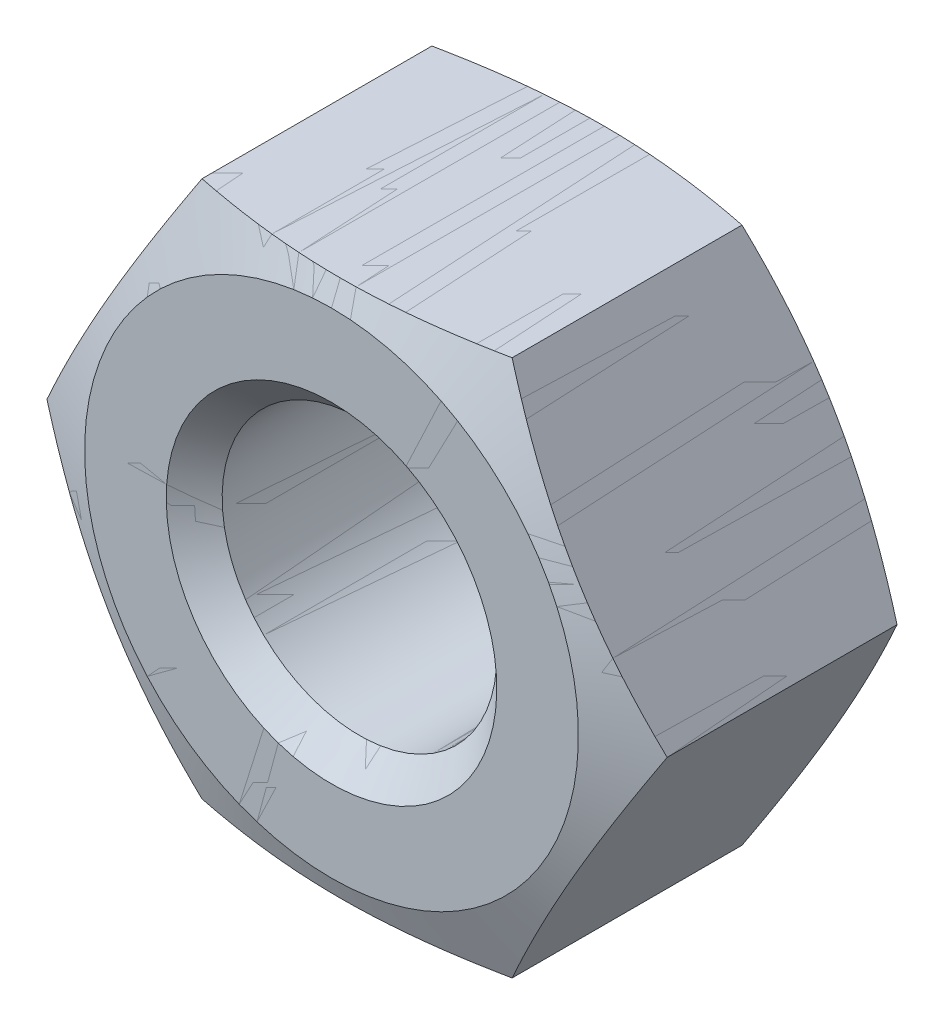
ISO-10303-21;
HEADER;
FILE_DESCRIPTION(('STEP AP214'),'2;1');
FILE_NAME('part.step','',(''),(''),'','','');
FILE_SCHEMA(('AUTOMOTIVE_DESIGN { 1 0 10303 214 1 1 1 1 }'));
ENDSEC;
DATA;
#1=APPLICATION_CONTEXT('core data for automotive mechanical design processes');
#2=APPLICATION_PROTOCOL_DEFINITION('international standard','automotive_design',2000,#1);
#3=PRODUCT_CONTEXT('',#1,'mechanical');
#4=PRODUCT('Part','Part','',(#3));
#5=PRODUCT_RELATED_PRODUCT_CATEGORY('part','',(#4));
#6=PRODUCT_DEFINITION_FORMATION('','',#4);
#7=PRODUCT_DEFINITION_CONTEXT('part definition',#1,'design');
#8=PRODUCT_DEFINITION('design','',#6,#7);
#9=PRODUCT_DEFINITION_SHAPE('','',#8);
#10=(LENGTH_UNIT() NAMED_UNIT(*) SI_UNIT(.MILLI.,.METRE.));
#11=(NAMED_UNIT(*) PLANE_ANGLE_UNIT() SI_UNIT($,.RADIAN.));
#12=(NAMED_UNIT(*) SI_UNIT($,.STERADIAN.) SOLID_ANGLE_UNIT());
#13=UNCERTAINTY_MEASURE_WITH_UNIT(LENGTH_MEASURE(1.E-05),#10,'distance_accuracy_value','');
#14=(GEOMETRIC_REPRESENTATION_CONTEXT(3) GLOBAL_UNCERTAINTY_ASSIGNED_CONTEXT((#13)) GLOBAL_UNIT_ASSIGNED_CONTEXT((#10,
#11,#12)) REPRESENTATION_CONTEXT('',''));
#15=CARTESIAN_POINT('',(0.,0.,0.));
#16=DIRECTION('',(0.,0.,1.));
#17=DIRECTION('',(1.,0.,0.));
#18=AXIS2_PLACEMENT_3D('',#15,#16,#17);
#19=CARTESIAN_POINT('',(7.50555,0.,6.8));
#20=DIRECTION('',(0.,0.,1.));
#21=DIRECTION('',(1.,0.,0.));
#22=AXIS2_PLACEMENT_3D('',#19,#20,#21);
#23=PLANE('',#22);
#24=CARTESIAN_POINT('',(0.,0.,6.8));
#25=DIRECTION('',(0.,0.,-1.));
#26=DIRECTION('',(0.,1.,0.));
#27=AXIS2_PLACEMENT_3D('',#24,#25,#26);
#28=CIRCLE('',#27,4.);
#29=CARTESIAN_POINT('',(0.,4.,6.8));
#30=VERTEX_POINT('',#29);
#31=EDGE_CURVE('P0_E540',#30,#30,#28,.T.);
#32=ORIENTED_EDGE('',*,*,#31,.T.);
#33=EDGE_LOOP('',(#32));
#34=FACE_BOUND('',#33,.T.);
#35=CARTESIAN_POINT('',(0.,0.,6.8));
#36=DIRECTION('',(0.,0.,-1.));
#37=DIRECTION('',(0.,1.,0.));
#38=AXIS2_PLACEMENT_3D('',#35,#36,#37);
#39=CIRCLE('',#38,5.9754963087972);
#40=CARTESIAN_POINT('',(0.,5.9754963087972,6.8));
#41=VERTEX_POINT('',#40);
#42=EDGE_CURVE('P0_E543',#41,#41,#39,.T.);
#43=ORIENTED_EDGE('',*,*,#42,.F.);
#44=EDGE_LOOP('',(#43));
#45=FACE_BOUND('',#44,.T.);
#46=ADVANCED_FACE('P0_F350',(#34,#45),#23,.T.);
#47=CARTESIAN_POINT('',(0.,0.,6.8));
#48=DIRECTION('',(0.,0.,1.));
#49=DIRECTION('',(0.,-1.,0.));
#50=AXIS2_PLACEMENT_3D('',#47,#48,#49);
#51=CONICAL_SURFACE('',#50,4.,0.785398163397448);
#52=CARTESIAN_POINT('',(0.,0.,6.1234375));
#53=DIRECTION('',(0.,0.,-1.));
#54=DIRECTION('',(0.,1.,0.));
#55=AXIS2_PLACEMENT_3D('',#52,#53,#54);
#56=CIRCLE('',#55,3.3234375);
#57=CARTESIAN_POINT('',(0.,3.3234375,6.1234375));
#58=VERTEX_POINT('',#57);
#59=EDGE_CURVE('P0_E431',#58,#58,#56,.T.);
#60=ORIENTED_EDGE('',*,*,#59,.T.);
#61=EDGE_LOOP('',(#60));
#62=FACE_BOUND('',#61,.T.);
#63=ORIENTED_EDGE('',*,*,#31,.F.);
#64=EDGE_LOOP('',(#63));
#65=FACE_BOUND('',#64,.T.);
#66=ADVANCED_FACE('P0_F474',(#62,#65),#51,.F.);
#67=CARTESIAN_POINT('',(0.,0.,0.));
#68=DIRECTION('',(0.,0.,-1.));
#69=DIRECTION('',(0.,1.,0.));
#70=AXIS2_PLACEMENT_3D('',#67,#68,#69);
#71=CYLINDRICAL_SURFACE('',#70,3.3234375);
#72=CARTESIAN_POINT('',(0.,0.,0.6765625));
#73=DIRECTION('',(0.,0.,-1.));
#74=DIRECTION('',(0.,1.,0.));
#75=AXIS2_PLACEMENT_3D('',#72,#73,#74);
#76=CIRCLE('',#75,3.3234375);
#77=CARTESIAN_POINT('',(0.,3.3234375,0.6765625));
#78=VERTEX_POINT('',#77);
#79=EDGE_CURVE('P0_E428',#78,#78,#76,.T.);
#80=ORIENTED_EDGE('',*,*,#79,.T.);
#81=EDGE_LOOP('',(#80));
#82=FACE_BOUND('',#81,.T.);
#83=ORIENTED_EDGE('',*,*,#59,.F.);
#84=EDGE_LOOP('',(#83));
#85=FACE_BOUND('',#84,.T.);
#86=ADVANCED_FACE('P0_F535',(#82,#85),#71,.F.);
#87=CARTESIAN_POINT('',(0.,0.,0.));
#88=DIRECTION('',(0.,0.,-1.));
#89=DIRECTION('',(0.,1.,0.));
#90=AXIS2_PLACEMENT_3D('',#87,#88,#89);
#91=CONICAL_SURFACE('',#90,4.,0.785398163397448);
#92=ORIENTED_EDGE('',*,*,#79,.F.);
#93=EDGE_LOOP('',(#92));
#94=FACE_BOUND('',#93,.T.);
#95=CARTESIAN_POINT('',(0.,0.,0.));
#96=DIRECTION('',(0.,0.,-1.));
#97=DIRECTION('',(0.,1.,0.));
#98=AXIS2_PLACEMENT_3D('',#95,#96,#97);
#99=CIRCLE('',#98,4.);
#100=CARTESIAN_POINT('',(0.,4.,0.));
#101=VERTEX_POINT('',#100);
#102=EDGE_CURVE('P0_E544',#101,#101,#99,.T.);
#103=ORIENTED_EDGE('',*,*,#102,.T.);
#104=EDGE_LOOP('',(#103));
#105=FACE_BOUND('',#104,.T.);
#106=ADVANCED_FACE('P0_F472',(#94,#105),#91,.F.);
#107=CARTESIAN_POINT('',(0.,0.,6.18181818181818));
#108=DIRECTION('',(0.,0.,-1.));
#109=DIRECTION('',(0.,1.,0.));
#110=AXIS2_PLACEMENT_3D('',#107,#108,#109);
#111=CONICAL_SURFACE('',#110,7.50555,1.18682389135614);
#112=ORIENTED_EDGE('',*,*,#42,.T.);
#113=EDGE_LOOP('',(#112));
#114=FACE_BOUND('',#113,.T.);
#115=CARTESIAN_POINT('',(-9.9193088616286,-6.49999696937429,4.42279492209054));
#116=CARTESIAN_POINT('',(-9.62612976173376,-6.49999696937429,4.5218419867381));
#117=CARTESIAN_POINT('',(-9.3325605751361,-6.49999696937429,4.61975569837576));
#118=CARTESIAN_POINT('',(-8.74444019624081,-6.49999696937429,4.81268318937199));
#119=CARTESIAN_POINT('',(-8.44988891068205,-6.49999696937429,4.90769668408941));
#120=CARTESIAN_POINT('',(-7.8589466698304,-6.49999696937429,5.09439618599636));
#121=CARTESIAN_POINT('',(-7.56255298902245,-6.49999696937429,5.18607359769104));
#122=CARTESIAN_POINT('',(-6.96842688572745,-6.49999696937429,5.36497357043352));
#123=CARTESIAN_POINT('',(-6.67069449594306,-6.49999696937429,5.45219623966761));
#124=CARTESIAN_POINT('',(-6.07749078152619,-6.49999696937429,5.61997733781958));
#125=CARTESIAN_POINT('',(-5.78203974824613,-6.49999696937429,5.70060715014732));
#126=CARTESIAN_POINT('',(-5.18934038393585,-6.49999696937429,5.85505393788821));
#127=CARTESIAN_POINT('',(-4.8920920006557,-6.49999696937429,5.92887071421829));
#128=CARTESIAN_POINT('',(-4.29575537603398,-6.49999696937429,6.06792713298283));
#129=CARTESIAN_POINT('',(-3.9966682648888,-6.49999696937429,6.13317158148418));
#130=CARTESIAN_POINT('',(-3.39636834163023,-6.49999696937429,6.25306571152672));
#131=CARTESIAN_POINT('',(-3.09515568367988,-6.49999696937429,6.30771615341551));
#132=CARTESIAN_POINT('',(-2.55247765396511,-6.49999696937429,6.3942718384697));
#133=CARTESIAN_POINT('',(-2.31139156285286,-6.49999696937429,6.42854298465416));
#134=CARTESIAN_POINT('',(-1.82807101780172,-6.49999696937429,6.4877891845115));
#135=CARTESIAN_POINT('',(-1.58583659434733,-6.49999696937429,6.51276448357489));
#136=CARTESIAN_POINT('',(-1.1006741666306,-6.49999696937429,6.55243028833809));
#137=CARTESIAN_POINT('',(-0.857746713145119,-6.49999696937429,6.56712744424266));
#138=CARTESIAN_POINT('',(-0.371473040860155,-6.49999696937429,6.5856209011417));
#139=CARTESIAN_POINT('',(-0.128126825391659,-6.49999696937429,6.58941728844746));
#140=CARTESIAN_POINT('',(0.359662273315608,-6.49999696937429,6.58592570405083));
#141=CARTESIAN_POINT('',(0.604104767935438,-6.49999696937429,6.57858403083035));
#142=CARTESIAN_POINT('',(1.09241838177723,-6.49999696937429,6.55305516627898));
#143=CARTESIAN_POINT('',(1.33628949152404,-6.49999696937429,6.53486779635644));
#144=CARTESIAN_POINT('',(1.82321426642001,-6.49999696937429,6.48841131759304));
#145=CARTESIAN_POINT('',(2.06626731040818,-6.49999696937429,6.46013578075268));
#146=CARTESIAN_POINT('',(2.55113865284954,-6.49999696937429,6.3945695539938));
#147=CARTESIAN_POINT('',(2.79295695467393,-6.4999969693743,6.35727888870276));
#148=CARTESIAN_POINT('',(3.31552776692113,-6.4999969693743,6.26797739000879));
#149=CARTESIAN_POINT('',(3.59603630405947,-6.4999969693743,6.21454818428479));
#150=CARTESIAN_POINT('',(4.15523748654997,-6.49999696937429,6.09884430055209));
#151=CARTESIAN_POINT('',(4.4339299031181,-6.49999696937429,6.03656852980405));
#152=CARTESIAN_POINT('',(4.98973006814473,-6.4999969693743,5.90477408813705));
#153=CARTESIAN_POINT('',(5.26683696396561,-6.49999696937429,5.8352518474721));
#154=CARTESIAN_POINT('',(5.81949820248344,-6.49999696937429,5.69036285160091));
#155=CARTESIAN_POINT('',(6.09505260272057,-6.4999969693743,5.61499631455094));
#156=CARTESIAN_POINT('',(6.64553916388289,-6.4999969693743,5.45932492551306));
#157=CARTESIAN_POINT('',(6.92046778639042,-6.4999969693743,5.37900761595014));
#158=CARTESIAN_POINT('',(7.46916437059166,-6.4999969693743,5.21450845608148));
#159=CARTESIAN_POINT('',(7.74293232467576,-6.4999969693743,5.13032658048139));
#160=CARTESIAN_POINT('',(8.28940004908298,-6.4999969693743,4.95883283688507));
#161=CARTESIAN_POINT('',(8.56210009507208,-6.4999969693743,4.87152184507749));
#162=CARTESIAN_POINT('',(9.10665643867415,-6.4999969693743,4.69430366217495));
#163=CARTESIAN_POINT('',(9.37851272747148,-6.4999969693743,4.60439644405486));
#164=CARTESIAN_POINT('',(10.1893622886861,-6.4999969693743,4.33269358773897));
#165=CARTESIAN_POINT('',(10.7273011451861,-6.4999969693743,4.1477522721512));
#166=CARTESIAN_POINT('',(11.8011433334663,-6.4999969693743,3.77195807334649));
#167=CARTESIAN_POINT('',(12.337046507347,-6.4999969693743,3.5811047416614));
#168=CARTESIAN_POINT('',(13.4037617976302,-6.4999969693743,3.19638995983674));
#169=CARTESIAN_POINT('',(13.934584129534,-6.4999969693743,3.00255679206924));
#170=CARTESIAN_POINT('',(14.7299098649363,-6.4999969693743,2.70945395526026));
#171=CARTESIAN_POINT('',(14.9948504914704,-6.4999969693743,2.6113670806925));
#172=CARTESIAN_POINT('',(15.5244732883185,-6.4999969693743,2.41450084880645));
#173=CARTESIAN_POINT('',(15.7891554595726,-6.4999969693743,2.31572149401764));
#174=CARTESIAN_POINT('',(16.053725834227,-6.4999969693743,2.21664343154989));
#175=B_SPLINE_CURVE_WITH_KNOTS('',3,(#115,#116,#117,#118,#119,#120,#121,#122,#123,#124,#125,
#126,#127,#128,#129,#130,#131,#132,#133,#134,#135,#136,#137,#138,#139,#140,#141,#142,#143,#144,
#145,#146,#147,#148,#149,#150,#151,#152,#153,#154,#155,#156,#157,#158,#159,#160,#161,#162,#163,
#164,#165,#166,#167,#168,#169,#170,#171,#172,#173,#174),.UNSPECIFIED.,.F.,.F.,(4,2,2,2,2,2,2,2,
2,2,2,2,2,2,2,2,2,2,2,2,2,2,2,2,2,2,2,2,2,4),(0.,0.928382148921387,1.85685512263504,
2.78757170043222,3.71826566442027,4.63696855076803,5.55569827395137,6.47391069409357,
7.39205718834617,8.12243097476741,8.85278547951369,9.58266698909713,10.3125427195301,
11.0459487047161,11.7793667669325,12.5132529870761,13.247137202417,14.1036136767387,
14.9601960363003,15.8172023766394,16.6741767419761,17.5334032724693,18.3926354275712,
19.2516288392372,20.1106311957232,21.8171010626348,23.523700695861,25.2190012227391,
26.0665447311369,26.9140851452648),.UNSPECIFIED.);
#176=CARTESIAN_POINT('',(-3.752775,-6.49999696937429,6.18181818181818));
#177=VERTEX_POINT('',#176);
#178=CARTESIAN_POINT('',(3.752775,-6.4999969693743,6.18181818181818));
#179=VERTEX_POINT('',#178);
#180=EDGE_CURVE('P0_E411',#177,#179,#175,.T.);
#181=ORIENTED_EDGE('',*,*,#180,.T.);
#182=CARTESIAN_POINT('',(3.75277488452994,-6.4999971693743,6.18181813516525));
#183=CARTESIAN_POINT('',(3.88388671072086,-6.27290482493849,6.23479379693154));
#184=CARTESIAN_POINT('',(4.0154312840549,-6.04506294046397,6.28377831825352));
#185=CARTESIAN_POINT('',(4.27939025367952,-5.5878725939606,6.37225953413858));
#186=CARTESIAN_POINT('',(4.41180511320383,-5.3585233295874,6.41175066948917));
#187=CARTESIAN_POINT('',(4.67731617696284,-4.89864467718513,6.47966399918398));
#188=CARTESIAN_POINT('',(4.81041216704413,-4.66811566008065,6.50808947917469));
#189=CARTESIAN_POINT('',(5.07709854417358,-4.20620130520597,6.55255421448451));
#190=CARTESIAN_POINT('',(5.21068881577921,-3.9748161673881,6.56859619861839));
#191=CARTESIAN_POINT('',(5.47583563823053,-3.51556839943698,6.58729635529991));
#192=CARTESIAN_POINT('',(5.60738820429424,-3.28771267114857,6.59017716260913));
#193=CARTESIAN_POINT('',(5.87041559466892,-2.83213586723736,6.58300544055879));
#194=CARTESIAN_POINT('',(6.00189041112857,-2.60441480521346,6.57295177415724));
#195=CARTESIAN_POINT('',(6.26436520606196,-2.1497951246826,6.54045156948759));
#196=CARTESIAN_POINT('',(6.39536543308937,-1.92289607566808,6.51801290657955));
#197=CARTESIAN_POINT('',(6.65674042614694,-1.4701813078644,6.46183013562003));
#198=CARTESIAN_POINT('',(6.78711525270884,-1.24436548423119,6.42808714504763));
#199=CARTESIAN_POINT('',(6.96628658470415,-0.934031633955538,6.37474923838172));
#200=CARTESIAN_POINT('',(7.01540954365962,-0.848948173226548,6.35940032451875));
#201=CARTESIAN_POINT('',(7.11353952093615,-0.67898206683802,6.32736591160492));
#202=CARTESIAN_POINT('',(7.16254655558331,-0.594099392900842,6.31068061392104));
#203=CARTESIAN_POINT('',(7.26061650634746,-0.424237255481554,6.27599122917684));
#204=CARTESIAN_POINT('',(7.30967903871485,-0.339258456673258,6.25798281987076));
#205=CARTESIAN_POINT('',(7.40769660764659,-0.169487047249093,6.22077431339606));
#206=CARTESIAN_POINT('',(7.45665163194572,-0.084694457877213,6.20157408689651));
#207=CARTESIAN_POINT('',(7.50555011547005,1.99999999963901E-07,6.18181813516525));
#208=B_SPLINE_CURVE_WITH_KNOTS('',3,(#182,#183,#184,#185,#186,#187,#188,#189,#190,#191,#192,
#193,#194,#195,#196,#197,#198,#199,#200,#201,#202,#203,#204,#205,#206,#207),.UNSPECIFIED.,.F.,
.F.,(4,2,2,2,2,2,2,2,2,2,2,2,4),(0.,0.802620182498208,1.60570923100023,2.40855964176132,
3.21123308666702,4.00027695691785,4.78939019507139,5.57800222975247,6.36653632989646,
6.66484369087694,6.96310618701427,7.26239050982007,7.56170736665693),.UNSPECIFIED.);
#209=CARTESIAN_POINT('',(7.50555,0.,6.18181818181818));
#210=VERTEX_POINT('',#209);
#211=EDGE_CURVE('P0_E496',#179,#210,#208,.T.);
#212=ORIENTED_EDGE('',*,*,#211,.T.);
#213=CARTESIAN_POINT('',(7.50555011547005,-2.0000000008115E-07,6.18181813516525));
#214=CARTESIAN_POINT('',(7.37443828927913,0.227092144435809,6.23479379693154));
#215=CARTESIAN_POINT('',(7.2428937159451,0.454934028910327,6.28377831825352));
#216=CARTESIAN_POINT('',(6.97893474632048,0.9121243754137,6.37225953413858));
#217=CARTESIAN_POINT('',(6.84651988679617,1.14147363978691,6.41175066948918));
#218=CARTESIAN_POINT('',(6.58100882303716,1.60135229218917,6.47966399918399));
#219=CARTESIAN_POINT('',(6.44791283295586,1.83188130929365,6.50808947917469));
#220=CARTESIAN_POINT('',(6.18122645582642,2.29379566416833,6.55255421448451));
#221=CARTESIAN_POINT('',(6.04763618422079,2.5251808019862,6.56859619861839));
#222=CARTESIAN_POINT('',(5.78248936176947,2.98442856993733,6.58729635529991));
#223=CARTESIAN_POINT('',(5.65093679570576,3.21228429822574,6.59017716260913));
#224=CARTESIAN_POINT('',(5.38790940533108,3.66786110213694,6.58300544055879));
#225=CARTESIAN_POINT('',(5.25643458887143,3.89558216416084,6.57295177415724));
#226=CARTESIAN_POINT('',(4.99395979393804,4.3502018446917,6.54045156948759));
#227=CARTESIAN_POINT('',(4.86295956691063,4.57710089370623,6.51801290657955));
#228=CARTESIAN_POINT('',(4.60158457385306,5.0298156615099,6.46183013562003));
#229=CARTESIAN_POINT('',(4.47120974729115,5.25563148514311,6.42808714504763));
#230=CARTESIAN_POINT('',(4.29203841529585,5.56596533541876,6.37474923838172));
#231=CARTESIAN_POINT('',(4.24291545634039,5.65104879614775,6.35940032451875));
#232=CARTESIAN_POINT('',(4.14478547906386,5.82101490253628,6.32736591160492));
#233=CARTESIAN_POINT('',(4.09577844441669,5.90589757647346,6.31068061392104));
#234=CARTESIAN_POINT('',(3.99770849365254,6.07575971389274,6.27599122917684));
#235=CARTESIAN_POINT('',(3.94864596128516,6.16073851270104,6.25798281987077));
#236=CARTESIAN_POINT('',(3.85062839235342,6.3305099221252,6.22077431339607));
#237=CARTESIAN_POINT('',(3.80167336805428,6.41530251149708,6.20157408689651));
#238=CARTESIAN_POINT('',(3.75277488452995,6.49999716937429,6.18181813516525));
#239=B_SPLINE_CURVE_WITH_KNOTS('',3,(#213,#214,#215,#216,#217,#218,#219,#220,#221,#222,#223,
#224,#225,#226,#227,#228,#229,#230,#231,#232,#233,#234,#235,#236,#237,#238),.UNSPECIFIED.,.F.,
.F.,(4,2,2,2,2,2,2,2,2,2,2,2,4),(0.,0.802620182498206,1.60570923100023,2.40855964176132,
3.21123308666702,4.00027695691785,4.78939019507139,5.57800222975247,6.36653632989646,
6.66484369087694,6.96310618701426,7.26239050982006,7.56170736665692),.UNSPECIFIED.);
#240=CARTESIAN_POINT('',(3.752775,6.49999696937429,6.18181818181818));
#241=VERTEX_POINT('',#240);
#242=EDGE_CURVE('P0_E373',#210,#241,#239,.T.);
#243=ORIENTED_EDGE('',*,*,#242,.T.);
#244=CARTESIAN_POINT('',(-9.91930886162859,6.4999969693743,4.42279492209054));
#245=CARTESIAN_POINT('',(-9.62612976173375,6.49999696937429,4.5218419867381));
#246=CARTESIAN_POINT('',(-9.3325605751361,6.49999696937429,4.61975569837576));
#247=CARTESIAN_POINT('',(-8.7444401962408,6.49999696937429,4.81268318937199));
#248=CARTESIAN_POINT('',(-8.44988891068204,6.49999696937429,4.90769668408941));
#249=CARTESIAN_POINT('',(-7.85894666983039,6.49999696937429,5.09439618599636));
#250=CARTESIAN_POINT('',(-7.56255298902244,6.49999696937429,5.18607359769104));
#251=CARTESIAN_POINT('',(-6.96842688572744,6.49999696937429,5.36497357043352));
#252=CARTESIAN_POINT('',(-6.67069449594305,6.49999696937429,5.4521962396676));
#253=CARTESIAN_POINT('',(-6.07749078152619,6.49999696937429,5.61997733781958));
#254=CARTESIAN_POINT('',(-5.78203974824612,6.49999696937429,5.70060715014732));
#255=CARTESIAN_POINT('',(-5.18934038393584,6.49999696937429,5.85505393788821));
#256=CARTESIAN_POINT('',(-4.89209200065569,6.49999696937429,5.92887071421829));
#257=CARTESIAN_POINT('',(-4.29575537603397,6.49999696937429,6.06792713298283));
#258=CARTESIAN_POINT('',(-3.99666826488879,6.49999696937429,6.13317158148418));
#259=CARTESIAN_POINT('',(-3.39636834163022,6.49999696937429,6.25306571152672));
#260=CARTESIAN_POINT('',(-3.09515568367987,6.4999969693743,6.30771615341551));
#261=CARTESIAN_POINT('',(-2.55247765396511,6.4999969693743,6.3942718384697));
#262=CARTESIAN_POINT('',(-2.31139156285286,6.49999696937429,6.42854298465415));
#263=CARTESIAN_POINT('',(-1.82807101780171,6.49999696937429,6.4877891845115));
#264=CARTESIAN_POINT('',(-1.58583659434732,6.49999696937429,6.51276448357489));
#265=CARTESIAN_POINT('',(-1.1006741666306,6.49999696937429,6.55243028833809));
#266=CARTESIAN_POINT('',(-0.857746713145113,6.49999696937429,6.56712744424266));
#267=CARTESIAN_POINT('',(-0.371473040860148,6.49999696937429,6.5856209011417));
#268=CARTESIAN_POINT('',(-0.128126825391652,6.49999696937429,6.58941728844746));
#269=CARTESIAN_POINT('',(0.359662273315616,6.49999696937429,6.58592570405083));
#270=CARTESIAN_POINT('',(0.604104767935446,6.49999696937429,6.57858403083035));
#271=CARTESIAN_POINT('',(1.09241838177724,6.49999696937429,6.55305516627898));
#272=CARTESIAN_POINT('',(1.33628949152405,6.49999696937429,6.53486779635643));
#273=CARTESIAN_POINT('',(1.82321426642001,6.49999696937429,6.48841131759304));
#274=CARTESIAN_POINT('',(2.06626731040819,6.49999696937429,6.46013578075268));
#275=CARTESIAN_POINT('',(2.55113865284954,6.49999696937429,6.3945695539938));
#276=CARTESIAN_POINT('',(2.79295695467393,6.49999696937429,6.35727888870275));
#277=CARTESIAN_POINT('',(3.31552776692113,6.49999696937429,6.26797739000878));
#278=CARTESIAN_POINT('',(3.59603630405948,6.49999696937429,6.21454818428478));
#279=CARTESIAN_POINT('',(4.15523748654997,6.49999696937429,6.09884430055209));
#280=CARTESIAN_POINT('',(4.4339299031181,6.49999696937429,6.03656852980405));
#281=CARTESIAN_POINT('',(4.98973006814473,6.49999696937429,5.90477408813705));
#282=CARTESIAN_POINT('',(5.26683696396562,6.49999696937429,5.8352518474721));
#283=CARTESIAN_POINT('',(5.81949820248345,6.49999696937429,5.69036285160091));
#284=CARTESIAN_POINT('',(6.09505260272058,6.49999696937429,5.61499631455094));
#285=CARTESIAN_POINT('',(6.6455391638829,6.49999696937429,5.45932492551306));
#286=CARTESIAN_POINT('',(6.92046778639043,6.49999696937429,5.37900761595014));
#287=CARTESIAN_POINT('',(7.46916437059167,6.49999696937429,5.21450845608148));
#288=CARTESIAN_POINT('',(7.74293232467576,6.49999696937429,5.13032658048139));
#289=CARTESIAN_POINT('',(8.28940004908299,6.49999696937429,4.95883283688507));
#290=CARTESIAN_POINT('',(8.56210009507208,6.49999696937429,4.87152184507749));
#291=CARTESIAN_POINT('',(9.10665643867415,6.49999696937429,4.69430366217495));
#292=CARTESIAN_POINT('',(9.37851272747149,6.49999696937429,4.60439644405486));
#293=CARTESIAN_POINT('',(10.1893622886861,6.49999696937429,4.33269358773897));
#294=CARTESIAN_POINT('',(10.7273011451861,6.49999696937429,4.1477522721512));
#295=CARTESIAN_POINT('',(11.8011433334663,6.49999696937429,3.77195807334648));
#296=CARTESIAN_POINT('',(12.337046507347,6.49999696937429,3.5811047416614));
#297=CARTESIAN_POINT('',(13.4037617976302,6.49999696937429,3.19638995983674));
#298=CARTESIAN_POINT('',(13.934584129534,6.49999696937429,3.00255679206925));
#299=CARTESIAN_POINT('',(14.7299098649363,6.49999696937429,2.70945395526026));
#300=CARTESIAN_POINT('',(14.9948504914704,6.49999696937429,2.6113670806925));
#301=CARTESIAN_POINT('',(15.5244732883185,6.49999696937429,2.41450084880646));
#302=CARTESIAN_POINT('',(15.7891554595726,6.49999696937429,2.31572149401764));
#303=CARTESIAN_POINT('',(16.053725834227,6.49999696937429,2.21664343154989));
#304=B_SPLINE_CURVE_WITH_KNOTS('',3,(#244,#245,#246,#247,#248,#249,#250,#251,#252,#253,#254,
#255,#256,#257,#258,#259,#260,#261,#262,#263,#264,#265,#266,#267,#268,#269,#270,#271,#272,#273,
#274,#275,#276,#277,#278,#279,#280,#281,#282,#283,#284,#285,#286,#287,#288,#289,#290,#291,#292,
#293,#294,#295,#296,#297,#298,#299,#300,#301,#302,#303),.UNSPECIFIED.,.F.,.F.,(4,2,2,2,2,2,2,2,
2,2,2,2,2,2,2,2,2,2,2,2,2,2,2,2,2,2,2,2,2,4),(0.,0.928382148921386,1.85685512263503,
2.78757170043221,3.71826566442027,4.63696855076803,5.55569827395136,6.47391069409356,
7.39205718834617,8.1224309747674,8.85278547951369,9.58266698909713,10.3125427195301,
11.0459487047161,11.7793667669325,12.513252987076,13.247137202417,14.1036136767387,
14.9601960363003,15.8172023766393,16.6741767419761,17.5334032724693,18.3926354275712,
19.2516288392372,20.1106311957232,21.8171010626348,23.523700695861,25.219001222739,
26.0665447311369,26.9140851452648),.UNSPECIFIED.);
#305=CARTESIAN_POINT('',(-3.752775,6.4999969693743,6.18181818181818));
#306=VERTEX_POINT('',#305);
#307=EDGE_CURVE('P0_E487',#241,#306,#304,.F.);
#308=ORIENTED_EDGE('',*,*,#307,.T.);
#309=CARTESIAN_POINT('',(-3.75277488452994,6.4999971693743,6.18181813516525));
#310=CARTESIAN_POINT('',(-3.88388671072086,6.27290482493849,6.23479379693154));
#311=CARTESIAN_POINT('',(-4.0154312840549,6.04506294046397,6.28377831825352));
#312=CARTESIAN_POINT('',(-4.27939025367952,5.5878725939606,6.37225953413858));
#313=CARTESIAN_POINT('',(-4.41180511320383,5.35852332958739,6.41175066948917));
#314=CARTESIAN_POINT('',(-4.67731617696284,4.89864467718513,6.47966399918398));
#315=CARTESIAN_POINT('',(-4.81041216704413,4.66811566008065,6.50808947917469));
#316=CARTESIAN_POINT('',(-5.07709854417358,4.20620130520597,6.55255421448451));
#317=CARTESIAN_POINT('',(-5.21068881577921,3.9748161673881,6.56859619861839));
#318=CARTESIAN_POINT('',(-5.47583563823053,3.51556839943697,6.58729635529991));
#319=CARTESIAN_POINT('',(-5.60738820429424,3.28771267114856,6.59017716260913));
#320=CARTESIAN_POINT('',(-5.87041559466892,2.83213586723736,6.58300544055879));
#321=CARTESIAN_POINT('',(-6.00189041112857,2.60441480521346,6.57295177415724));
#322=CARTESIAN_POINT('',(-6.26436520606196,2.1497951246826,6.54045156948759));
#323=CARTESIAN_POINT('',(-6.39536543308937,1.92289607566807,6.51801290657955));
#324=CARTESIAN_POINT('',(-6.65674042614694,1.47018130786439,6.46183013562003));
#325=CARTESIAN_POINT('',(-6.78711525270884,1.24436548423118,6.42808714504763));
#326=CARTESIAN_POINT('',(-6.96628658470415,0.934031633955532,6.37474923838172));
#327=CARTESIAN_POINT('',(-7.01540954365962,0.848948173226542,6.35940032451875));
#328=CARTESIAN_POINT('',(-7.11353952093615,0.678982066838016,6.32736591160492));
#329=CARTESIAN_POINT('',(-7.16254655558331,0.594099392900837,6.31068061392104));
#330=CARTESIAN_POINT('',(-7.26061650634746,0.424237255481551,6.27599122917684));
#331=CARTESIAN_POINT('',(-7.30967903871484,0.339258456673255,6.25798281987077));
#332=CARTESIAN_POINT('',(-7.40769660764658,0.169487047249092,6.22077431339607));
#333=CARTESIAN_POINT('',(-7.45665163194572,0.0846944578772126,6.20157408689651));
#334=CARTESIAN_POINT('',(-7.50555011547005,-1.99999999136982E-07,6.18181813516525));
#335=B_SPLINE_CURVE_WITH_KNOTS('',3,(#309,#310,#311,#312,#313,#314,#315,#316,#317,#318,#319,
#320,#321,#322,#323,#324,#325,#326,#327,#328,#329,#330,#331,#332,#333,#334),.UNSPECIFIED.,.F.,
.F.,(4,2,2,2,2,2,2,2,2,2,2,2,4),(0.,0.802620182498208,1.60570923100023,2.40855964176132,
3.21123308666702,4.00027695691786,4.78939019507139,5.57800222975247,6.36653632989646,
6.66484369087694,6.96310618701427,7.26239050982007,7.56170736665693),.UNSPECIFIED.);
#336=CARTESIAN_POINT('',(-7.50555,0.,6.18181818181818));
#337=VERTEX_POINT('',#336);
#338=EDGE_CURVE('P0_E482',#306,#337,#335,.T.);
#339=ORIENTED_EDGE('',*,*,#338,.T.);
#340=CARTESIAN_POINT('',(-7.50555011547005,2.00000000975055E-07,6.18181813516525));
#341=CARTESIAN_POINT('',(-7.37443828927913,-0.227092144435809,6.23479379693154));
#342=CARTESIAN_POINT('',(-7.2428937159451,-0.454934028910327,6.28377831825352));
#343=CARTESIAN_POINT('',(-6.97893474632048,-0.9121243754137,6.37225953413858));
#344=CARTESIAN_POINT('',(-6.84651988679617,-1.14147363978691,6.41175066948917));
#345=CARTESIAN_POINT('',(-6.58100882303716,-1.60135229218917,6.47966399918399));
#346=CARTESIAN_POINT('',(-6.44791283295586,-1.83188130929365,6.50808947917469));
#347=CARTESIAN_POINT('',(-6.18122645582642,-2.29379566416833,6.55255421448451));
#348=CARTESIAN_POINT('',(-6.04763618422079,-2.5251808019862,6.56859619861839));
#349=CARTESIAN_POINT('',(-5.78248936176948,-2.98442856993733,6.58729635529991));
#350=CARTESIAN_POINT('',(-5.65093679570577,-3.21228429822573,6.59017716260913));
#351=CARTESIAN_POINT('',(-5.38790940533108,-3.66786110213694,6.58300544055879));
#352=CARTESIAN_POINT('',(-5.25643458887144,-3.89558216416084,6.57295177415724));
#353=CARTESIAN_POINT('',(-4.99395979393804,-4.35020184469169,6.54045156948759));
#354=CARTESIAN_POINT('',(-4.86295956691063,-4.57710089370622,6.51801290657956));
#355=CARTESIAN_POINT('',(-4.60158457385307,-5.0298156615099,6.46183013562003));
#356=CARTESIAN_POINT('',(-4.47120974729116,-5.25563148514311,6.42808714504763));
#357=CARTESIAN_POINT('',(-4.29203841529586,-5.56596533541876,6.37474923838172));
#358=CARTESIAN_POINT('',(-4.24291545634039,-5.65104879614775,6.35940032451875));
#359=CARTESIAN_POINT('',(-4.14478547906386,-5.82101490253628,6.32736591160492));
#360=CARTESIAN_POINT('',(-4.09577844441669,-5.90589757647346,6.31068061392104));
#361=CARTESIAN_POINT('',(-3.99770849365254,-6.07575971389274,6.27599122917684));
#362=CARTESIAN_POINT('',(-3.94864596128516,-6.16073851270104,6.25798281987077));
#363=CARTESIAN_POINT('',(-3.85062839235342,-6.3305099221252,6.22077431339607));
#364=CARTESIAN_POINT('',(-3.80167336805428,-6.41530251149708,6.20157408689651));
#365=CARTESIAN_POINT('',(-3.75277488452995,-6.49999716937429,6.18181813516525));
#366=B_SPLINE_CURVE_WITH_KNOTS('',3,(#340,#341,#342,#343,#344,#345,#346,#347,#348,#349,#350,
#351,#352,#353,#354,#355,#356,#357,#358,#359,#360,#361,#362,#363,#364,#365),.UNSPECIFIED.,.F.,
.F.,(4,2,2,2,2,2,2,2,2,2,2,2,4),(0.,0.802620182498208,1.60570923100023,2.40855964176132,
3.21123308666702,4.00027695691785,4.78939019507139,5.57800222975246,6.36653632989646,
6.66484369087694,6.96310618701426,7.26239050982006,7.56170736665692),.UNSPECIFIED.);
#367=EDGE_CURVE('P0_E459',#337,#177,#366,.T.);
#368=ORIENTED_EDGE('',*,*,#367,.T.);
#369=EDGE_LOOP('',(#181,#212,#243,#308,#339,#368));
#370=FACE_BOUND('',#369,.T.);
#371=ADVANCED_FACE('P0_F468',(#114,#370),#111,.T.);
#372=CARTESIAN_POINT('',(3.752775,-6.4999969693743,6.8));
#373=DIRECTION('',(-0.866025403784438,0.5,0.));
#374=DIRECTION('',(-0.5,-0.866025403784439,0.));
#375=AXIS2_PLACEMENT_3D('',#372,#373,#374);
#376=PLANE('',#375);
#377=ORIENTED_EDGE('',*,*,#211,.F.);
#378=DIRECTION('',(0.,0.,-1.));
#379=VECTOR('',#378,1.);
#380=CARTESIAN_POINT('',(3.752775,-6.4999969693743,6.8));
#381=LINE('',#380,#379);
#382=CARTESIAN_POINT('',(3.752775,-6.4999969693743,0.618181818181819));
#383=VERTEX_POINT('',#382);
#384=EDGE_CURVE('P0_E415',#179,#383,#381,.T.);
#385=ORIENTED_EDGE('',*,*,#384,.T.);
#386=CARTESIAN_POINT('',(7.50555011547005,2.E-07,0.618181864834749));
#387=CARTESIAN_POINT('',(7.37443828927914,-0.227092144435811,0.565206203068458));
#388=CARTESIAN_POINT('',(7.2428937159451,-0.45493402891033,0.516221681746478));
#389=CARTESIAN_POINT('',(6.97893474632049,-0.912124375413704,0.427740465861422));
#390=CARTESIAN_POINT('',(6.84651988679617,-1.14147363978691,0.388249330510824));
#391=CARTESIAN_POINT('',(6.58100882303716,-1.60135229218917,0.320336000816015));
#392=CARTESIAN_POINT('',(6.44791283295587,-1.83188130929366,0.291910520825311));
#393=CARTESIAN_POINT('',(6.18122645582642,-2.29379566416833,0.247445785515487));
#394=CARTESIAN_POINT('',(6.04763618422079,-2.52518080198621,0.231403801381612));
#395=CARTESIAN_POINT('',(5.78248936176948,-2.98442856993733,0.212703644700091));
#396=CARTESIAN_POINT('',(5.65093679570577,-3.21228429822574,0.209822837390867));
#397=CARTESIAN_POINT('',(5.38790940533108,-3.66786110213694,0.216994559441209));
#398=CARTESIAN_POINT('',(5.25643458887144,-3.89558216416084,0.22704822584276));
#399=CARTESIAN_POINT('',(4.99395979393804,-4.3502018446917,0.259548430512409));
#400=CARTESIAN_POINT('',(4.86295956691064,-4.57710089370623,0.281987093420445));
#401=CARTESIAN_POINT('',(4.60158457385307,-5.0298156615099,0.338169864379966));
#402=CARTESIAN_POINT('',(4.47120974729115,-5.25563148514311,0.371912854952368));
#403=CARTESIAN_POINT('',(4.29203841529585,-5.56596533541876,0.425250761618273));
#404=CARTESIAN_POINT('',(4.24291545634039,-5.65104879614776,0.440599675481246));
#405=CARTESIAN_POINT('',(4.14478547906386,-5.82101490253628,0.472634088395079));
#406=CARTESIAN_POINT('',(4.09577844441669,-5.90589757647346,0.489319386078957));
#407=CARTESIAN_POINT('',(3.99770849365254,-6.07575971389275,0.524008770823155));
#408=CARTESIAN_POINT('',(3.94864596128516,-6.16073851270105,0.542017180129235));
#409=CARTESIAN_POINT('',(3.85062839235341,-6.33050992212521,0.579225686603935));
#410=CARTESIAN_POINT('',(3.80167336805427,-6.41530251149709,0.598425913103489));
#411=CARTESIAN_POINT('',(3.75277488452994,-6.4999971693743,0.61818186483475));
#412=B_SPLINE_CURVE_WITH_KNOTS('',3,(#386,#387,#388,#389,#390,#391,#392,#393,#394,#395,#396,
#397,#398,#399,#400,#401,#402,#403,#404,#405,#406,#407,#408,#409,#410,#411),.UNSPECIFIED.,.F.,
.F.,(4,2,2,2,2,2,2,2,2,2,2,2,4),(0.,0.802620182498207,1.60570923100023,2.40855964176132,
3.21123308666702,4.00027695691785,4.78939019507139,5.57800222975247,6.36653632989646,
6.66484369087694,6.96310618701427,7.26239050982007,7.56170736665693),.UNSPECIFIED.);
#413=CARTESIAN_POINT('',(7.50555,0.,0.618181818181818));
#414=VERTEX_POINT('',#413);
#415=EDGE_CURVE('P0_E366',#414,#383,#412,.T.);
#416=ORIENTED_EDGE('',*,*,#415,.F.);
#417=DIRECTION('',(0.,0.,-1.));
#418=VECTOR('',#417,1.);
#419=CARTESIAN_POINT('',(7.50555,0.,6.8));
#420=LINE('',#419,#418);
#421=EDGE_CURVE('P0_E359',#210,#414,#420,.T.);
#422=ORIENTED_EDGE('',*,*,#421,.F.);
#423=EDGE_LOOP('',(#377,#385,#416,#422));
#424=FACE_BOUND('',#423,.T.);
#425=ADVANCED_FACE('P0_F352',(#424),#376,.F.);
#426=CARTESIAN_POINT('',(7.50555,0.,6.8));
#427=DIRECTION('',(-0.866025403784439,-0.5,0.));
#428=DIRECTION('',(0.5,-0.866025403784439,0.));
#429=AXIS2_PLACEMENT_3D('',#426,#427,#428);
#430=PLANE('',#429);
#431=ORIENTED_EDGE('',*,*,#242,.F.);
#432=ORIENTED_EDGE('',*,*,#421,.T.);
#433=CARTESIAN_POINT('',(3.75277488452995,6.49999716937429,0.618181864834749));
#434=CARTESIAN_POINT('',(3.88388671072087,6.27290482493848,0.565206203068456));
#435=CARTESIAN_POINT('',(4.0154312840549,6.04506294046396,0.516221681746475));
#436=CARTESIAN_POINT('',(4.27939025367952,5.58787259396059,0.427740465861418));
#437=CARTESIAN_POINT('',(4.41180511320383,5.35852332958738,0.388249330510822));
#438=CARTESIAN_POINT('',(4.67731617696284,4.89864467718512,0.320336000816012));
#439=CARTESIAN_POINT('',(4.81041216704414,4.66811566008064,0.291910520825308));
#440=CARTESIAN_POINT('',(5.07709854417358,4.20620130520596,0.247445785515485));
#441=CARTESIAN_POINT('',(5.21068881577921,3.97481616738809,0.23140380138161));
#442=CARTESIAN_POINT('',(5.47583563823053,3.51556839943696,0.212703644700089));
#443=CARTESIAN_POINT('',(5.60738820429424,3.28771267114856,0.209822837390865));
#444=CARTESIAN_POINT('',(5.87041559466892,2.83213586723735,0.216994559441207));
#445=CARTESIAN_POINT('',(6.00189041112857,2.60441480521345,0.227048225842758));
#446=CARTESIAN_POINT('',(6.26436520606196,2.1497951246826,0.259548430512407));
#447=CARTESIAN_POINT('',(6.39536543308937,1.92289607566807,0.281987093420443));
#448=CARTESIAN_POINT('',(6.65674042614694,1.47018130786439,0.338169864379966));
#449=CARTESIAN_POINT('',(6.78711525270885,1.24436548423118,0.37191285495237));
#450=CARTESIAN_POINT('',(6.96628658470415,0.934031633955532,0.425250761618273));
#451=CARTESIAN_POINT('',(7.01540954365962,0.848948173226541,0.440599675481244));
#452=CARTESIAN_POINT('',(7.11353952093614,0.678982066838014,0.472634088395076));
#453=CARTESIAN_POINT('',(7.16254655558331,0.594099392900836,0.489319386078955));
#454=CARTESIAN_POINT('',(7.26061650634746,0.424237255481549,0.524008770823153));
#455=CARTESIAN_POINT('',(7.30967903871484,0.339258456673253,0.542017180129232));
#456=CARTESIAN_POINT('',(7.40769660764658,0.16948704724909,0.579225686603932));
#457=CARTESIAN_POINT('',(7.45665163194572,0.0846944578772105,0.598425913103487));
#458=CARTESIAN_POINT('',(7.50555011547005,-2.00000000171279E-07,0.618181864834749));
#459=B_SPLINE_CURVE_WITH_KNOTS('',3,(#433,#434,#435,#436,#437,#438,#439,#440,#441,#442,#443,
#444,#445,#446,#447,#448,#449,#450,#451,#452,#453,#454,#455,#456,#457,#458),.UNSPECIFIED.,.F.,
.F.,(4,2,2,2,2,2,2,2,2,2,2,2,4),(0.,0.802620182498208,1.60570923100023,2.40855964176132,
3.21123308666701,4.00027695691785,4.78939019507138,5.57800222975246,6.36653632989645,
6.66484369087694,6.96310618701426,7.26239050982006,7.56170736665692),.UNSPECIFIED.);
#460=CARTESIAN_POINT('',(3.752775,6.49999696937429,0.618181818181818));
#461=VERTEX_POINT('',#460);
#462=EDGE_CURVE('P0_E507',#461,#414,#459,.T.);
#463=ORIENTED_EDGE('',*,*,#462,.F.);
#464=DIRECTION('',(0.,0.,-1.));
#465=VECTOR('',#464,1.);
#466=CARTESIAN_POINT('',(3.752775,6.49999696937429,6.8));
#467=LINE('',#466,#465);
#468=EDGE_CURVE('P0_E625',#241,#461,#467,.T.);
#469=ORIENTED_EDGE('',*,*,#468,.F.);
#470=EDGE_LOOP('',(#431,#432,#463,#469));
#471=FACE_BOUND('',#470,.T.);
#472=ADVANCED_FACE('P0_F501',(#471),#430,.F.);
#473=CARTESIAN_POINT('',(3.752775,6.49999696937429,6.8));
#474=DIRECTION('',(0.,-1.,0.));
#475=DIRECTION('',(1.,0.,0.));
#476=AXIS2_PLACEMENT_3D('',#473,#474,#475);
#477=PLANE('',#476);
#478=ORIENTED_EDGE('',*,*,#307,.F.);
#479=ORIENTED_EDGE('',*,*,#468,.T.);
#480=CARTESIAN_POINT('',(-9.91930886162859,6.4999969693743,2.37720507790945));
#481=CARTESIAN_POINT('',(-9.62612976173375,6.49999696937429,2.27815801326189));
#482=CARTESIAN_POINT('',(-9.33256057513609,6.49999696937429,2.18024430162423));
#483=CARTESIAN_POINT('',(-8.7444401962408,6.49999696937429,1.98731681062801));
#484=CARTESIAN_POINT('',(-8.44988891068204,6.49999696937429,1.89230331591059));
#485=CARTESIAN_POINT('',(-7.85894666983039,6.49999696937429,1.70560381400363));
#486=CARTESIAN_POINT('',(-7.56255298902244,6.49999696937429,1.61392640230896));
#487=CARTESIAN_POINT('',(-6.96842688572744,6.49999696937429,1.43502642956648));
#488=CARTESIAN_POINT('',(-6.67069449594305,6.49999696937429,1.34780376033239));
#489=CARTESIAN_POINT('',(-6.07749078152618,6.49999696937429,1.18002266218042));
#490=CARTESIAN_POINT('',(-5.78203974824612,6.49999696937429,1.09939284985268));
#491=CARTESIAN_POINT('',(-5.18934038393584,6.49999696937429,0.944946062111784));
#492=CARTESIAN_POINT('',(-4.89209200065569,6.49999696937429,0.871129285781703));
#493=CARTESIAN_POINT('',(-4.29575537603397,6.49999696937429,0.73207286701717));
#494=CARTESIAN_POINT('',(-3.99666826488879,6.49999696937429,0.666828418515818));
#495=CARTESIAN_POINT('',(-3.39636834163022,6.49999696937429,0.546934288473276));
#496=CARTESIAN_POINT('',(-3.09515568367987,6.4999969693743,0.492283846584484));
#497=CARTESIAN_POINT('',(-2.55247765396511,6.4999969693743,0.405728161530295));
#498=CARTESIAN_POINT('',(-2.31139156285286,6.49999696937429,0.371457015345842));
#499=CARTESIAN_POINT('',(-1.82807101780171,6.49999696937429,0.312210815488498));
#500=CARTESIAN_POINT('',(-1.58583659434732,6.49999696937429,0.287235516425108));
#501=CARTESIAN_POINT('',(-1.1006741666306,6.49999696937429,0.247569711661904));
#502=CARTESIAN_POINT('',(-0.857746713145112,6.49999696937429,0.232872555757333));
#503=CARTESIAN_POINT('',(-0.371473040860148,6.49999696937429,0.214379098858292));
#504=CARTESIAN_POINT('',(-0.128126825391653,6.49999696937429,0.21058271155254));
#505=CARTESIAN_POINT('',(0.359662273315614,6.49999696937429,0.214074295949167));
#506=CARTESIAN_POINT('',(0.604104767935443,6.49999696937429,0.22141596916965));
#507=CARTESIAN_POINT('',(1.09241838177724,6.49999696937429,0.246944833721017));
#508=CARTESIAN_POINT('',(1.33628949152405,6.49999696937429,0.265132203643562));
#509=CARTESIAN_POINT('',(1.82321426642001,6.49999696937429,0.311588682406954));
#510=CARTESIAN_POINT('',(2.06626731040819,6.49999696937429,0.339864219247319));
#511=CARTESIAN_POINT('',(2.55113865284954,6.49999696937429,0.405430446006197));
#512=CARTESIAN_POINT('',(2.79295695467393,6.49999696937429,0.442721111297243));
#513=CARTESIAN_POINT('',(3.31552776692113,6.49999696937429,0.532022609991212));
#514=CARTESIAN_POINT('',(3.59603630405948,6.49999696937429,0.585451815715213));
#515=CARTESIAN_POINT('',(4.15523748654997,6.49999696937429,0.70115569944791));
#516=CARTESIAN_POINT('',(4.4339299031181,6.49999696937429,0.763431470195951));
#517=CARTESIAN_POINT('',(4.98973006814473,6.49999696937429,0.895225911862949));
#518=CARTESIAN_POINT('',(5.26683696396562,6.49999696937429,0.9647481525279));
#519=CARTESIAN_POINT('',(5.81949820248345,6.49999696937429,1.10963714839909));
#520=CARTESIAN_POINT('',(6.09505260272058,6.49999696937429,1.18500368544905));
#521=CARTESIAN_POINT('',(6.6455391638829,6.49999696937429,1.34067507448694));
#522=CARTESIAN_POINT('',(6.92046778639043,6.49999696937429,1.42099238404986));
#523=CARTESIAN_POINT('',(7.46916437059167,6.49999696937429,1.58549154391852));
#524=CARTESIAN_POINT('',(7.74293232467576,6.49999696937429,1.66967341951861));
#525=CARTESIAN_POINT('',(8.28940004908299,6.49999696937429,1.84116716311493));
#526=CARTESIAN_POINT('',(8.56210009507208,6.49999696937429,1.9284781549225));
#527=CARTESIAN_POINT('',(9.10665643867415,6.49999696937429,2.10569633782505));
#528=CARTESIAN_POINT('',(9.37851272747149,6.49999696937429,2.19560355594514));
#529=CARTESIAN_POINT('',(10.1893622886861,6.49999696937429,2.46730641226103));
#530=CARTESIAN_POINT('',(10.7273011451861,6.49999696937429,2.6522477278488));
#531=CARTESIAN_POINT('',(11.8011433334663,6.49999696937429,3.02804192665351));
#532=CARTESIAN_POINT('',(12.337046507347,6.49999696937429,3.2188952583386));
#533=CARTESIAN_POINT('',(13.4037617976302,6.49999696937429,3.60361004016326));
#534=CARTESIAN_POINT('',(13.934584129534,6.49999696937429,3.79744320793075));
#535=CARTESIAN_POINT('',(14.7299098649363,6.49999696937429,4.09054604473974));
#536=CARTESIAN_POINT('',(14.9948504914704,6.49999696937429,4.1886329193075));
#537=CARTESIAN_POINT('',(15.5244732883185,6.49999696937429,4.38549915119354));
#538=CARTESIAN_POINT('',(15.7891554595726,6.49999696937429,4.48427850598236));
#539=CARTESIAN_POINT('',(16.053725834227,6.49999696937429,4.58335656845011));
#540=B_SPLINE_CURVE_WITH_KNOTS('',3,(#480,#481,#482,#483,#484,#485,#486,#487,#488,#489,#490,
#491,#492,#493,#494,#495,#496,#497,#498,#499,#500,#501,#502,#503,#504,#505,#506,#507,#508,#509,
#510,#511,#512,#513,#514,#515,#516,#517,#518,#519,#520,#521,#522,#523,#524,#525,#526,#527,#528,
#529,#530,#531,#532,#533,#534,#535,#536,#537,#538,#539),.UNSPECIFIED.,.F.,.F.,(4,2,2,2,2,2,2,2,
2,2,2,2,2,2,2,2,2,2,2,2,2,2,2,2,2,2,2,2,2,4),(0.,0.928382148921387,1.85685512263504,
2.78757170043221,3.71826566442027,4.63696855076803,5.55569827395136,6.47391069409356,
7.39205718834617,8.1224309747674,8.85278547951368,9.58266698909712,10.3125427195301,
11.045948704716,11.7793667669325,12.513252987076,13.2471372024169,14.1036136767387,
14.9601960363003,15.8172023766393,16.6741767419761,17.5334032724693,18.3926354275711,
19.2516288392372,20.1106311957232,21.8171010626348,23.523700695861,25.219001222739,
26.0665447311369,26.9140851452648),.UNSPECIFIED.);
#541=CARTESIAN_POINT('',(-3.752775,6.4999969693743,0.618181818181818));
#542=VERTEX_POINT('',#541);
#543=EDGE_CURVE('P0_E512',#542,#461,#540,.T.);
#544=ORIENTED_EDGE('',*,*,#543,.F.);
#545=DIRECTION('',(0.,0.,-1.));
#546=VECTOR('',#545,1.);
#547=CARTESIAN_POINT('',(-3.752775,6.4999969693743,6.8));
#548=LINE('',#547,#546);
#549=EDGE_CURVE('P0_E627',#306,#542,#548,.T.);
#550=ORIENTED_EDGE('',*,*,#549,.F.);
#551=EDGE_LOOP('',(#478,#479,#544,#550));
#552=FACE_BOUND('',#551,.T.);
#553=ADVANCED_FACE('P0_F504',(#552),#477,.F.);
#554=CARTESIAN_POINT('',(-3.752775,6.4999969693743,6.8));
#555=DIRECTION('',(0.866025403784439,-0.5,0.));
#556=DIRECTION('',(0.5,0.866025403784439,0.));
#557=AXIS2_PLACEMENT_3D('',#554,#555,#556);
#558=PLANE('',#557);
#559=ORIENTED_EDGE('',*,*,#338,.F.);
#560=ORIENTED_EDGE('',*,*,#549,.T.);
#561=CARTESIAN_POINT('',(-7.50555011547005,-1.99999999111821E-07,0.618181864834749));
#562=CARTESIAN_POINT('',(-7.37443828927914,0.22709214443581,0.565206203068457));
#563=CARTESIAN_POINT('',(-7.2428937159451,0.454934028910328,0.516221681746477));
#564=CARTESIAN_POINT('',(-6.97893474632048,0.912124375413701,0.42774046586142));
#565=CARTESIAN_POINT('',(-6.84651988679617,1.14147363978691,0.388249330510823));
#566=CARTESIAN_POINT('',(-6.58100882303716,1.60135229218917,0.320336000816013));
#567=CARTESIAN_POINT('',(-6.44791283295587,1.83188130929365,0.291910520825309));
#568=CARTESIAN_POINT('',(-6.18122645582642,2.29379566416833,0.247445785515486));
#569=CARTESIAN_POINT('',(-6.04763618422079,2.52518080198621,0.231403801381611));
#570=CARTESIAN_POINT('',(-5.78248936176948,2.98442856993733,0.21270364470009));
#571=CARTESIAN_POINT('',(-5.65093679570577,3.21228429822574,0.209822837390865));
#572=CARTESIAN_POINT('',(-5.38790940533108,3.66786110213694,0.216994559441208));
#573=CARTESIAN_POINT('',(-5.25643458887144,3.89558216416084,0.227048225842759));
#574=CARTESIAN_POINT('',(-4.99395979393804,4.3502018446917,0.259548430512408));
#575=CARTESIAN_POINT('',(-4.86295956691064,4.57710089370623,0.281987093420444));
#576=CARTESIAN_POINT('',(-4.60158457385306,5.0298156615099,0.338169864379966));
#577=CARTESIAN_POINT('',(-4.47120974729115,5.25563148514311,0.371912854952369));
#578=CARTESIAN_POINT('',(-4.29203841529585,5.56596533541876,0.425250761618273));
#579=CARTESIAN_POINT('',(-4.24291545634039,5.65104879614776,0.440599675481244));
#580=CARTESIAN_POINT('',(-4.14478547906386,5.82101490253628,0.472634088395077));
#581=CARTESIAN_POINT('',(-4.09577844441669,5.90589757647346,0.489319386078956));
#582=CARTESIAN_POINT('',(-3.99770849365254,6.07575971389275,0.524008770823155));
#583=CARTESIAN_POINT('',(-3.94864596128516,6.16073851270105,0.542017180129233));
#584=CARTESIAN_POINT('',(-3.85062839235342,6.33050992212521,0.579225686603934));
#585=CARTESIAN_POINT('',(-3.80167336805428,6.41530251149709,0.598425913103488));
#586=CARTESIAN_POINT('',(-3.75277488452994,6.4999971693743,0.618181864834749));
#587=B_SPLINE_CURVE_WITH_KNOTS('',3,(#561,#562,#563,#564,#565,#566,#567,#568,#569,#570,#571,
#572,#573,#574,#575,#576,#577,#578,#579,#580,#581,#582,#583,#584,#585,#586),.UNSPECIFIED.,.F.,
.F.,(4,2,2,2,2,2,2,2,2,2,2,2,4),(0.,0.802620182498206,1.60570923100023,2.40855964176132,
3.21123308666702,4.00027695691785,4.78939019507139,5.57800222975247,6.36653632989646,
6.66484369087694,6.96310618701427,7.26239050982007,7.56170736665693),.UNSPECIFIED.);
#588=CARTESIAN_POINT('',(-7.50555,0.,0.618181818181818));
#589=VERTEX_POINT('',#588);
#590=EDGE_CURVE('P0_E424',#589,#542,#587,.T.);
#591=ORIENTED_EDGE('',*,*,#590,.F.);
#592=DIRECTION('',(0.,0.,-1.));
#593=VECTOR('',#592,1.);
#594=CARTESIAN_POINT('',(-7.50555,0.,6.8));
#595=LINE('',#594,#593);
#596=EDGE_CURVE('P0_E414',#337,#589,#595,.T.);
#597=ORIENTED_EDGE('',*,*,#596,.F.);
#598=EDGE_LOOP('',(#559,#560,#591,#597));
#599=FACE_BOUND('',#598,.T.);
#600=ADVANCED_FACE('P0_F520',(#599),#558,.F.);
#601=CARTESIAN_POINT('',(-7.50555,0.,6.8));
#602=DIRECTION('',(0.866025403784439,0.5,0.));
#603=DIRECTION('',(-0.5,0.866025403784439,0.));
#604=AXIS2_PLACEMENT_3D('',#601,#602,#603);
#605=PLANE('',#604);
#606=ORIENTED_EDGE('',*,*,#367,.F.);
#607=ORIENTED_EDGE('',*,*,#596,.T.);
#608=CARTESIAN_POINT('',(-3.75277488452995,-6.49999716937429,0.61818186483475));
#609=CARTESIAN_POINT('',(-3.88388671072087,-6.27290482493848,0.565206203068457));
#610=CARTESIAN_POINT('',(-4.0154312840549,-6.04506294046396,0.516221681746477));
#611=CARTESIAN_POINT('',(-4.27939025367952,-5.58787259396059,0.427740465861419));
#612=CARTESIAN_POINT('',(-4.41180511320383,-5.35852332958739,0.388249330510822));
#613=CARTESIAN_POINT('',(-4.67731617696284,-4.89864467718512,0.320336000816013));
#614=CARTESIAN_POINT('',(-4.81041216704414,-4.66811566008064,0.291910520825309));
#615=CARTESIAN_POINT('',(-5.07709854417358,-4.20620130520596,0.247445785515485));
#616=CARTESIAN_POINT('',(-5.21068881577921,-3.97481616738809,0.23140380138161));
#617=CARTESIAN_POINT('',(-5.47583563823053,-3.51556839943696,0.212703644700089));
#618=CARTESIAN_POINT('',(-5.60738820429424,-3.28771267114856,0.209822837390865));
#619=CARTESIAN_POINT('',(-5.87041559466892,-2.83213586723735,0.216994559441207));
#620=CARTESIAN_POINT('',(-6.00189041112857,-2.60441480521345,0.227048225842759));
#621=CARTESIAN_POINT('',(-6.26436520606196,-2.1497951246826,0.259548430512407));
#622=CARTESIAN_POINT('',(-6.39536543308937,-1.92289607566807,0.281987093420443));
#623=CARTESIAN_POINT('',(-6.65674042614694,-1.47018130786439,0.338169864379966));
#624=CARTESIAN_POINT('',(-6.78711525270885,-1.24436548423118,0.37191285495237));
#625=CARTESIAN_POINT('',(-6.96628658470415,-0.934031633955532,0.425250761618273));
#626=CARTESIAN_POINT('',(-7.01540954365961,-0.848948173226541,0.440599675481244));
#627=CARTESIAN_POINT('',(-7.11353952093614,-0.678982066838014,0.472634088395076));
#628=CARTESIAN_POINT('',(-7.16254655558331,-0.594099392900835,0.489319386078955));
#629=CARTESIAN_POINT('',(-7.26061650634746,-0.424237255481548,0.524008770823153));
#630=CARTESIAN_POINT('',(-7.30967903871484,-0.339258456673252,0.542017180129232));
#631=CARTESIAN_POINT('',(-7.40769660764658,-0.169487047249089,0.579225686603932));
#632=CARTESIAN_POINT('',(-7.45665163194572,-0.0846944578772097,0.598425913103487));
#633=CARTESIAN_POINT('',(-7.50555011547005,2.0000000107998E-07,0.618181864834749));
#634=B_SPLINE_CURVE_WITH_KNOTS('',3,(#608,#609,#610,#611,#612,#613,#614,#615,#616,#617,#618,
#619,#620,#621,#622,#623,#624,#625,#626,#627,#628,#629,#630,#631,#632,#633),.UNSPECIFIED.,.F.,
.F.,(4,2,2,2,2,2,2,2,2,2,2,2,4),(0.,0.802620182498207,1.60570923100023,2.40855964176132,
3.21123308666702,4.00027695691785,4.78939019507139,5.57800222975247,6.36653632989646,
6.66484369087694,6.96310618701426,7.26239050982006,7.56170736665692),.UNSPECIFIED.);
#635=CARTESIAN_POINT('',(-3.752775,-6.49999696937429,0.618181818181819));
#636=VERTEX_POINT('',#635);
#637=EDGE_CURVE('P0_E419',#636,#589,#634,.T.);
#638=ORIENTED_EDGE('',*,*,#637,.F.);
#639=DIRECTION('',(0.,0.,-1.));
#640=VECTOR('',#639,1.);
#641=CARTESIAN_POINT('',(-3.752775,-6.49999696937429,6.8));
#642=LINE('',#641,#640);
#643=EDGE_CURVE('P0_E405',#177,#636,#642,.T.);
#644=ORIENTED_EDGE('',*,*,#643,.F.);
#645=EDGE_LOOP('',(#606,#607,#638,#644));
#646=FACE_BOUND('',#645,.T.);
#647=ADVANCED_FACE('P0_F420',(#646),#605,.F.);
#648=CARTESIAN_POINT('',(-3.752775,-6.49999696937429,6.8));
#649=DIRECTION('',(0.,1.,0.));
#650=DIRECTION('',(-1.,0.,0.));
#651=AXIS2_PLACEMENT_3D('',#648,#649,#650);
#652=PLANE('',#651);
#653=ORIENTED_EDGE('',*,*,#180,.F.);
#654=ORIENTED_EDGE('',*,*,#643,.T.);
#655=CARTESIAN_POINT('',(-9.9193088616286,-6.49999696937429,2.37720507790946));
#656=CARTESIAN_POINT('',(-9.62612976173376,-6.49999696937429,2.2781580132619));
#657=CARTESIAN_POINT('',(-9.3325605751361,-6.49999696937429,2.18024430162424));
#658=CARTESIAN_POINT('',(-8.7444401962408,-6.49999696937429,1.98731681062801));
#659=CARTESIAN_POINT('',(-8.44988891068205,-6.49999696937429,1.89230331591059));
#660=CARTESIAN_POINT('',(-7.8589466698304,-6.49999696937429,1.70560381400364));
#661=CARTESIAN_POINT('',(-7.56255298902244,-6.49999696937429,1.61392640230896));
#662=CARTESIAN_POINT('',(-6.96842688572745,-6.49999696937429,1.43502642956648));
#663=CARTESIAN_POINT('',(-6.67069449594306,-6.49999696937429,1.34780376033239));
#664=CARTESIAN_POINT('',(-6.07749078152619,-6.49999696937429,1.18002266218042));
#665=CARTESIAN_POINT('',(-5.78203974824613,-6.49999696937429,1.09939284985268));
#666=CARTESIAN_POINT('',(-5.18934038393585,-6.49999696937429,0.944946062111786));
#667=CARTESIAN_POINT('',(-4.8920920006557,-6.49999696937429,0.871129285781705));
#668=CARTESIAN_POINT('',(-4.29575537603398,-6.49999696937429,0.732072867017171));
#669=CARTESIAN_POINT('',(-3.9966682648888,-6.49999696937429,0.666828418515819));
#670=CARTESIAN_POINT('',(-3.39636834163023,-6.49999696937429,0.546934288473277));
#671=CARTESIAN_POINT('',(-3.09515568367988,-6.49999696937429,0.492283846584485));
#672=CARTESIAN_POINT('',(-2.55247765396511,-6.49999696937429,0.405728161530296));
#673=CARTESIAN_POINT('',(-2.31139156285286,-6.49999696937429,0.371457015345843));
#674=CARTESIAN_POINT('',(-1.82807101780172,-6.49999696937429,0.3122108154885));
#675=CARTESIAN_POINT('',(-1.58583659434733,-6.49999696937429,0.287235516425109));
#676=CARTESIAN_POINT('',(-1.1006741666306,-6.49999696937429,0.247569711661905));
#677=CARTESIAN_POINT('',(-0.857746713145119,-6.49999696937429,0.232872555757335));
#678=CARTESIAN_POINT('',(-0.371473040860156,-6.49999696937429,0.214379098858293));
#679=CARTESIAN_POINT('',(-0.128126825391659,-6.49999696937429,0.210582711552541));
#680=CARTESIAN_POINT('',(0.359662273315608,-6.49999696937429,0.214074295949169));
#681=CARTESIAN_POINT('',(0.604104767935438,-6.49999696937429,0.221415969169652));
#682=CARTESIAN_POINT('',(1.09241838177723,-6.49999696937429,0.246944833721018));
#683=CARTESIAN_POINT('',(1.33628949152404,-6.49999696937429,0.265132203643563));
#684=CARTESIAN_POINT('',(1.82321426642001,-6.49999696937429,0.311588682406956));
#685=CARTESIAN_POINT('',(2.06626731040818,-6.49999696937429,0.339864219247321));
#686=CARTESIAN_POINT('',(2.55113865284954,-6.49999696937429,0.405430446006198));
#687=CARTESIAN_POINT('',(2.79295695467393,-6.4999969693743,0.442721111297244));
#688=CARTESIAN_POINT('',(3.31552776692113,-6.4999969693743,0.532022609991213));
#689=CARTESIAN_POINT('',(3.59603630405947,-6.4999969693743,0.585451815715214));
#690=CARTESIAN_POINT('',(4.15523748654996,-6.49999696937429,0.70115569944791));
#691=CARTESIAN_POINT('',(4.43392990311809,-6.49999696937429,0.763431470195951));
#692=CARTESIAN_POINT('',(4.98973006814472,-6.4999969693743,0.895225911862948));
#693=CARTESIAN_POINT('',(5.2668369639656,-6.49999696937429,0.964748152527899));
#694=CARTESIAN_POINT('',(5.81949820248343,-6.49999696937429,1.10963714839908));
#695=CARTESIAN_POINT('',(6.09505260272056,-6.4999969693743,1.18500368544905));
#696=CARTESIAN_POINT('',(6.64553916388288,-6.4999969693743,1.34067507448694));
#697=CARTESIAN_POINT('',(6.92046778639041,-6.4999969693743,1.42099238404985));
#698=CARTESIAN_POINT('',(7.46916437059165,-6.4999969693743,1.58549154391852));
#699=CARTESIAN_POINT('',(7.74293232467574,-6.4999969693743,1.66967341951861));
#700=CARTESIAN_POINT('',(8.28940004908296,-6.4999969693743,1.84116716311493));
#701=CARTESIAN_POINT('',(8.56210009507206,-6.4999969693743,1.9284781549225));
#702=CARTESIAN_POINT('',(9.10665643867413,-6.4999969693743,2.10569633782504));
#703=CARTESIAN_POINT('',(9.37851272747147,-6.4999969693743,2.19560355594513));
#704=CARTESIAN_POINT('',(10.1893622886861,-6.4999969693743,2.46730641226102));
#705=CARTESIAN_POINT('',(10.7273011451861,-6.4999969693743,2.65224772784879));
#706=CARTESIAN_POINT('',(11.8011433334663,-6.4999969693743,3.0280419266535));
#707=CARTESIAN_POINT('',(12.3370465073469,-6.4999969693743,3.21889525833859));
#708=CARTESIAN_POINT('',(13.4037617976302,-6.4999969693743,3.60361004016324));
#709=CARTESIAN_POINT('',(13.934584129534,-6.4999969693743,3.79744320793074));
#710=CARTESIAN_POINT('',(14.7299098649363,-6.4999969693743,4.09054604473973));
#711=CARTESIAN_POINT('',(14.9948504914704,-6.4999969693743,4.18863291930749));
#712=CARTESIAN_POINT('',(15.5244732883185,-6.4999969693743,4.38549915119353));
#713=CARTESIAN_POINT('',(15.7891554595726,-6.4999969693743,4.48427850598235));
#714=CARTESIAN_POINT('',(16.0537258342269,-6.4999969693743,4.58335656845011));
#715=B_SPLINE_CURVE_WITH_KNOTS('',3,(#655,#656,#657,#658,#659,#660,#661,#662,#663,#664,#665,
#666,#667,#668,#669,#670,#671,#672,#673,#674,#675,#676,#677,#678,#679,#680,#681,#682,#683,#684,
#685,#686,#687,#688,#689,#690,#691,#692,#693,#694,#695,#696,#697,#698,#699,#700,#701,#702,#703,
#704,#705,#706,#707,#708,#709,#710,#711,#712,#713,#714),.UNSPECIFIED.,.F.,.F.,(4,2,2,2,2,2,2,2,
2,2,2,2,2,2,2,2,2,2,2,2,2,2,2,2,2,2,2,2,2,4),(0.,0.928382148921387,1.85685512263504,
2.78757170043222,3.71826566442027,4.63696855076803,5.55569827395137,6.47391069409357,
7.39205718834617,8.12243097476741,8.85278547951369,9.58266698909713,10.3125427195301,
11.0459487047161,11.7793667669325,12.5132529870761,13.247137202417,14.1036136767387,
14.9601960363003,15.8172023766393,16.6741767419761,17.5334032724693,18.3926354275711,
19.2516288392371,20.1106311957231,21.8171010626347,23.523700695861,25.219001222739,
26.0665447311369,26.9140851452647),.UNSPECIFIED.);
#716=EDGE_CURVE('P0_E409',#383,#636,#715,.F.);
#717=ORIENTED_EDGE('',*,*,#716,.F.);
#718=ORIENTED_EDGE('',*,*,#384,.F.);
#719=EDGE_LOOP('',(#653,#654,#717,#718));
#720=FACE_BOUND('',#719,.T.);
#721=ADVANCED_FACE('P0_F407',(#720),#652,.F.);
#722=CARTESIAN_POINT('',(0.,0.,0.));
#723=DIRECTION('',(0.,0.,1.));
#724=DIRECTION('',(0.,-1.,0.));
#725=AXIS2_PLACEMENT_3D('',#722,#723,#724);
#726=CONICAL_SURFACE('',#725,5.9754963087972,1.18682389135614);
#727=CARTESIAN_POINT('',(0.,0.,0.));
#728=DIRECTION('',(0.,0.,1.));
#729=DIRECTION('',(1.,0.,0.));
#730=AXIS2_PLACEMENT_3D('',#727,#728,#729);
#731=CIRCLE('',#730,5.9754963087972);
#732=CARTESIAN_POINT('',(5.9754963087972,0.,0.));
#733=VERTEX_POINT('',#732);
#734=EDGE_CURVE('P0_E11',#733,#733,#731,.T.);
#735=ORIENTED_EDGE('',*,*,#734,.T.);
#736=EDGE_LOOP('',(#735));
#737=FACE_BOUND('',#736,.T.);
#738=ORIENTED_EDGE('',*,*,#462,.T.);
#739=ORIENTED_EDGE('',*,*,#415,.T.);
#740=ORIENTED_EDGE('',*,*,#716,.T.);
#741=ORIENTED_EDGE('',*,*,#637,.T.);
#742=ORIENTED_EDGE('',*,*,#590,.T.);
#743=ORIENTED_EDGE('',*,*,#543,.T.);
#744=EDGE_LOOP('',(#738,#739,#740,#741,#742,#743));
#745=FACE_BOUND('',#744,.T.);
#746=ADVANCED_FACE('P0_F427',(#737,#745),#726,.T.);
#747=CARTESIAN_POINT('',(7.50555,0.,0.));
#748=DIRECTION('',(0.,0.,1.));
#749=DIRECTION('',(1.,0.,0.));
#750=AXIS2_PLACEMENT_3D('',#747,#748,#749);
#751=PLANE('',#750);
#752=ORIENTED_EDGE('',*,*,#734,.F.);
#753=EDGE_LOOP('',(#752));
#754=FACE_BOUND('',#753,.T.);
#755=ORIENTED_EDGE('',*,*,#102,.F.);
#756=EDGE_LOOP('',(#755));
#757=FACE_BOUND('',#756,.T.);
#758=ADVANCED_FACE('P0_F560',(#754,#757),#751,.F.);
#759=CLOSED_SHELL('',(#46,#66,#86,#106,#371,#425,#472,#553,#600,#647,#721,#746,#758));
#760=MANIFOLD_SOLID_BREP('P0_B2',#759);
#761=CARTESIAN_POINT('',(7.50555,0.,6.8));
#762=DIRECTION('',(0.,0.,1.));
#763=DIRECTION('',(1.,0.,0.));
#764=AXIS2_PLACEMENT_3D('',#761,#762,#763);
#765=PLANE('',#764);
#766=CARTESIAN_POINT('',(0.,0.,6.8));
#767=DIRECTION('',(0.,0.,-1.));
#768=DIRECTION('',(0.,1.,0.));
#769=AXIS2_PLACEMENT_3D('',#766,#767,#768);
#770=CIRCLE('',#769,4.);
#771=CARTESIAN_POINT('',(0.,4.,6.8));
#772=VERTEX_POINT('',#771);
#773=EDGE_CURVE('P1_E193',#772,#772,#770,.T.);
#774=ORIENTED_EDGE('',*,*,#773,.T.);
#775=EDGE_LOOP('',(#774));
#776=FACE_BOUND('',#775,.T.);
#777=CARTESIAN_POINT('',(0.,0.,6.8));
#778=DIRECTION('',(0.,0.,-1.));
#779=DIRECTION('',(0.,1.,0.));
#780=AXIS2_PLACEMENT_3D('',#777,#778,#779);
#781=CIRCLE('',#780,5.9754963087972);
#782=CARTESIAN_POINT('',(0.,5.9754963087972,6.8));
#783=VERTEX_POINT('',#782);
#784=EDGE_CURVE('P1_E196',#783,#783,#781,.T.);
#785=ORIENTED_EDGE('',*,*,#784,.F.);
#786=EDGE_LOOP('',(#785));
#787=FACE_BOUND('',#786,.T.);
#788=ADVANCED_FACE('P1_F15',(#776,#787),#765,.T.);
#789=CARTESIAN_POINT('',(0.,0.,6.8));
#790=DIRECTION('',(0.,0.,1.));
#791=DIRECTION('',(0.,-1.,0.));
#792=AXIS2_PLACEMENT_3D('',#789,#790,#791);
#793=CONICAL_SURFACE('',#792,4.,0.785398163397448);
#794=CARTESIAN_POINT('',(0.,0.,6.1234375));
#795=DIRECTION('',(0.,0.,-1.));
#796=DIRECTION('',(0.,1.,0.));
#797=AXIS2_PLACEMENT_3D('',#794,#795,#796);
#798=CIRCLE('',#797,3.3234375);
#799=CARTESIAN_POINT('',(0.,3.3234375,6.1234375));
#800=VERTEX_POINT('',#799);
#801=EDGE_CURVE('P1_E96',#800,#800,#798,.T.);
#802=ORIENTED_EDGE('',*,*,#801,.T.);
#803=EDGE_LOOP('',(#802));
#804=FACE_BOUND('',#803,.T.);
#805=ORIENTED_EDGE('',*,*,#773,.F.);
#806=EDGE_LOOP('',(#805));
#807=FACE_BOUND('',#806,.T.);
#808=ADVANCED_FACE('P1_F137',(#804,#807),#793,.F.);
#809=CARTESIAN_POINT('',(0.,0.,0.));
#810=DIRECTION('',(0.,0.,-1.));
#811=DIRECTION('',(0.,1.,0.));
#812=AXIS2_PLACEMENT_3D('',#809,#810,#811);
#813=CYLINDRICAL_SURFACE('',#812,3.3234375);
#814=CARTESIAN_POINT('',(0.,0.,0.6765625));
#815=DIRECTION('',(0.,0.,-1.));
#816=DIRECTION('',(0.,1.,0.));
#817=AXIS2_PLACEMENT_3D('',#814,#815,#816);
#818=CIRCLE('',#817,3.3234375);
#819=CARTESIAN_POINT('',(0.,3.3234375,0.6765625));
#820=VERTEX_POINT('',#819);
#821=EDGE_CURVE('P1_E93',#820,#820,#818,.T.);
#822=ORIENTED_EDGE('',*,*,#821,.T.);
#823=EDGE_LOOP('',(#822));
#824=FACE_BOUND('',#823,.T.);
#825=ORIENTED_EDGE('',*,*,#801,.F.);
#826=EDGE_LOOP('',(#825));
#827=FACE_BOUND('',#826,.T.);
#828=ADVANCED_FACE('P1_F188',(#824,#827),#813,.F.);
#829=CARTESIAN_POINT('',(0.,0.,0.));
#830=DIRECTION('',(0.,0.,-1.));
#831=DIRECTION('',(0.,1.,0.));
#832=AXIS2_PLACEMENT_3D('',#829,#830,#831);
#833=CONICAL_SURFACE('',#832,4.,0.785398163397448);
#834=ORIENTED_EDGE('',*,*,#821,.F.);
#835=EDGE_LOOP('',(#834));
#836=FACE_BOUND('',#835,.T.);
#837=CARTESIAN_POINT('',(0.,0.,0.));
#838=DIRECTION('',(0.,0.,-1.));
#839=DIRECTION('',(0.,1.,0.));
#840=AXIS2_PLACEMENT_3D('',#837,#838,#839);
#841=CIRCLE('',#840,4.);
#842=CARTESIAN_POINT('',(0.,4.,0.));
#843=VERTEX_POINT('',#842);
#844=EDGE_CURVE('P1_E197',#843,#843,#841,.T.);
#845=ORIENTED_EDGE('',*,*,#844,.T.);
#846=EDGE_LOOP('',(#845));
#847=FACE_BOUND('',#846,.T.);
#848=ADVANCED_FACE('P1_F135',(#836,#847),#833,.F.);
#849=CARTESIAN_POINT('',(0.,0.,6.18181818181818));
#850=DIRECTION('',(0.,0.,-1.));
#851=DIRECTION('',(0.,1.,0.));
#852=AXIS2_PLACEMENT_3D('',#849,#850,#851);
#853=CONICAL_SURFACE('',#852,7.50555,1.18682389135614);
#854=ORIENTED_EDGE('',*,*,#784,.T.);
#855=EDGE_LOOP('',(#854));
#856=FACE_BOUND('',#855,.T.);
#857=CARTESIAN_POINT('',(-9.9193088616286,-6.49999696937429,4.42279492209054));
#858=CARTESIAN_POINT('',(-9.62612976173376,-6.49999696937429,4.5218419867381));
#859=CARTESIAN_POINT('',(-9.3325605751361,-6.49999696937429,4.61975569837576));
#860=CARTESIAN_POINT('',(-8.74444019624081,-6.49999696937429,4.81268318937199));
#861=CARTESIAN_POINT('',(-8.44988891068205,-6.49999696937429,4.90769668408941));
#862=CARTESIAN_POINT('',(-7.8589466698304,-6.49999696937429,5.09439618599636));
#863=CARTESIAN_POINT('',(-7.56255298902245,-6.49999696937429,5.18607359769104));
#864=CARTESIAN_POINT('',(-6.96842688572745,-6.49999696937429,5.36497357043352));
#865=CARTESIAN_POINT('',(-6.67069449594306,-6.49999696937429,5.45219623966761));
#866=CARTESIAN_POINT('',(-6.07749078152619,-6.49999696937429,5.61997733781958));
#867=CARTESIAN_POINT('',(-5.78203974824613,-6.49999696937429,5.70060715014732));
#868=CARTESIAN_POINT('',(-5.18934038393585,-6.49999696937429,5.85505393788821));
#869=CARTESIAN_POINT('',(-4.8920920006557,-6.49999696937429,5.92887071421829));
#870=CARTESIAN_POINT('',(-4.29575537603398,-6.49999696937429,6.06792713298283));
#871=CARTESIAN_POINT('',(-3.9966682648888,-6.49999696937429,6.13317158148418));
#872=CARTESIAN_POINT('',(-3.39636834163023,-6.49999696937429,6.25306571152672));
#873=CARTESIAN_POINT('',(-3.09515568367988,-6.49999696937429,6.30771615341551));
#874=CARTESIAN_POINT('',(-2.55247765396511,-6.49999696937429,6.3942718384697));
#875=CARTESIAN_POINT('',(-2.31139156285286,-6.49999696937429,6.42854298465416));
#876=CARTESIAN_POINT('',(-1.82807101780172,-6.49999696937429,6.4877891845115));
#877=CARTESIAN_POINT('',(-1.58583659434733,-6.49999696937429,6.51276448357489));
#878=CARTESIAN_POINT('',(-1.1006741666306,-6.49999696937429,6.55243028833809));
#879=CARTESIAN_POINT('',(-0.857746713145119,-6.49999696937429,6.56712744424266));
#880=CARTESIAN_POINT('',(-0.371473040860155,-6.49999696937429,6.5856209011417));
#881=CARTESIAN_POINT('',(-0.128126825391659,-6.49999696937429,6.58941728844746));
#882=CARTESIAN_POINT('',(0.359662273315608,-6.49999696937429,6.58592570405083));
#883=CARTESIAN_POINT('',(0.604104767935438,-6.49999696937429,6.57858403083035));
#884=CARTESIAN_POINT('',(1.09241838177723,-6.49999696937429,6.55305516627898));
#885=CARTESIAN_POINT('',(1.33628949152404,-6.49999696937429,6.53486779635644));
#886=CARTESIAN_POINT('',(1.82321426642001,-6.49999696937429,6.48841131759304));
#887=CARTESIAN_POINT('',(2.06626731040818,-6.49999696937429,6.46013578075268));
#888=CARTESIAN_POINT('',(2.55113865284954,-6.49999696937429,6.3945695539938));
#889=CARTESIAN_POINT('',(2.79295695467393,-6.4999969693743,6.35727888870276));
#890=CARTESIAN_POINT('',(3.31552776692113,-6.4999969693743,6.26797739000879));
#891=CARTESIAN_POINT('',(3.59603630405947,-6.4999969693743,6.21454818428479));
#892=CARTESIAN_POINT('',(4.15523748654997,-6.49999696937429,6.09884430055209));
#893=CARTESIAN_POINT('',(4.4339299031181,-6.49999696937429,6.03656852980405));
#894=CARTESIAN_POINT('',(4.98973006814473,-6.4999969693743,5.90477408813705));
#895=CARTESIAN_POINT('',(5.26683696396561,-6.49999696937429,5.8352518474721));
#896=CARTESIAN_POINT('',(5.81949820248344,-6.49999696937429,5.69036285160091));
#897=CARTESIAN_POINT('',(6.09505260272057,-6.4999969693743,5.61499631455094));
#898=CARTESIAN_POINT('',(6.64553916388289,-6.4999969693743,5.45932492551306));
#899=CARTESIAN_POINT('',(6.92046778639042,-6.4999969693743,5.37900761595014));
#900=CARTESIAN_POINT('',(7.46916437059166,-6.4999969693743,5.21450845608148));
#901=CARTESIAN_POINT('',(7.74293232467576,-6.4999969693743,5.13032658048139));
#902=CARTESIAN_POINT('',(8.28940004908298,-6.4999969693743,4.95883283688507));
#903=CARTESIAN_POINT('',(8.56210009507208,-6.4999969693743,4.87152184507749));
#904=CARTESIAN_POINT('',(9.10665643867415,-6.4999969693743,4.69430366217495));
#905=CARTESIAN_POINT('',(9.37851272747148,-6.4999969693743,4.60439644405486));
#906=CARTESIAN_POINT('',(10.1893622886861,-6.4999969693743,4.33269358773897));
#907=CARTESIAN_POINT('',(10.7273011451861,-6.4999969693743,4.1477522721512));
#908=CARTESIAN_POINT('',(11.8011433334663,-6.4999969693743,3.77195807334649));
#909=CARTESIAN_POINT('',(12.337046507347,-6.4999969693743,3.5811047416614));
#910=CARTESIAN_POINT('',(13.4037617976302,-6.4999969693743,3.19638995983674));
#911=CARTESIAN_POINT('',(13.934584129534,-6.4999969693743,3.00255679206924));
#912=CARTESIAN_POINT('',(14.7299098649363,-6.4999969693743,2.70945395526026));
#913=CARTESIAN_POINT('',(14.9948504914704,-6.4999969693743,2.6113670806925));
#914=CARTESIAN_POINT('',(15.5244732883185,-6.4999969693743,2.41450084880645));
#915=CARTESIAN_POINT('',(15.7891554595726,-6.4999969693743,2.31572149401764));
#916=CARTESIAN_POINT('',(16.053725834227,-6.4999969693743,2.21664343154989));
#917=B_SPLINE_CURVE_WITH_KNOTS('',3,(#857,#858,#859,#860,#861,#862,#863,#864,#865,#866,#867,
#868,#869,#870,#871,#872,#873,#874,#875,#876,#877,#878,#879,#880,#881,#882,#883,#884,#885,#886,
#887,#888,#889,#890,#891,#892,#893,#894,#895,#896,#897,#898,#899,#900,#901,#902,#903,#904,#905,
#906,#907,#908,#909,#910,#911,#912,#913,#914,#915,#916),.UNSPECIFIED.,.F.,.F.,(4,2,2,2,2,2,2,2,
2,2,2,2,2,2,2,2,2,2,2,2,2,2,2,2,2,2,2,2,2,4),(0.,0.928382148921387,1.85685512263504,
2.78757170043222,3.71826566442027,4.63696855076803,5.55569827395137,6.47391069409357,
7.39205718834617,8.12243097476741,8.85278547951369,9.58266698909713,10.3125427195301,
11.0459487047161,11.7793667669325,12.5132529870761,13.247137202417,14.1036136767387,
14.9601960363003,15.8172023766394,16.6741767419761,17.5334032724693,18.3926354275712,
19.2516288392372,20.1106311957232,21.8171010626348,23.523700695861,25.2190012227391,
26.0665447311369,26.9140851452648),.UNSPECIFIED.);
#918=CARTESIAN_POINT('',(-3.752775,-6.49999696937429,6.18181818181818));
#919=VERTEX_POINT('',#918);
#920=CARTESIAN_POINT('',(3.752775,-6.4999969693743,6.18181818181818));
#921=VERTEX_POINT('',#920);
#922=EDGE_CURVE('P1_E76',#919,#921,#917,.T.);
#923=ORIENTED_EDGE('',*,*,#922,.T.);
#924=CARTESIAN_POINT('',(3.75277488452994,-6.4999971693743,6.18181813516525));
#925=CARTESIAN_POINT('',(3.88388671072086,-6.27290482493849,6.23479379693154));
#926=CARTESIAN_POINT('',(4.0154312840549,-6.04506294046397,6.28377831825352));
#927=CARTESIAN_POINT('',(4.27939025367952,-5.5878725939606,6.37225953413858));
#928=CARTESIAN_POINT('',(4.41180511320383,-5.3585233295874,6.41175066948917));
#929=CARTESIAN_POINT('',(4.67731617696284,-4.89864467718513,6.47966399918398));
#930=CARTESIAN_POINT('',(4.81041216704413,-4.66811566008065,6.50808947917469));
#931=CARTESIAN_POINT('',(5.07709854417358,-4.20620130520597,6.55255421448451));
#932=CARTESIAN_POINT('',(5.21068881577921,-3.9748161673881,6.56859619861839));
#933=CARTESIAN_POINT('',(5.47583563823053,-3.51556839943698,6.58729635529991));
#934=CARTESIAN_POINT('',(5.60738820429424,-3.28771267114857,6.59017716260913));
#935=CARTESIAN_POINT('',(5.87041559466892,-2.83213586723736,6.58300544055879));
#936=CARTESIAN_POINT('',(6.00189041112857,-2.60441480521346,6.57295177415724));
#937=CARTESIAN_POINT('',(6.26436520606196,-2.1497951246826,6.54045156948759));
#938=CARTESIAN_POINT('',(6.39536543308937,-1.92289607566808,6.51801290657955));
#939=CARTESIAN_POINT('',(6.65674042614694,-1.4701813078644,6.46183013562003));
#940=CARTESIAN_POINT('',(6.78711525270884,-1.24436548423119,6.42808714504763));
#941=CARTESIAN_POINT('',(6.96628658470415,-0.934031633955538,6.37474923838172));
#942=CARTESIAN_POINT('',(7.01540954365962,-0.848948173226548,6.35940032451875));
#943=CARTESIAN_POINT('',(7.11353952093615,-0.67898206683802,6.32736591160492));
#944=CARTESIAN_POINT('',(7.16254655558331,-0.594099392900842,6.31068061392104));
#945=CARTESIAN_POINT('',(7.26061650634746,-0.424237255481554,6.27599122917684));
#946=CARTESIAN_POINT('',(7.30967903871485,-0.339258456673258,6.25798281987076));
#947=CARTESIAN_POINT('',(7.40769660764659,-0.169487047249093,6.22077431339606));
#948=CARTESIAN_POINT('',(7.45665163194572,-0.084694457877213,6.20157408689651));
#949=CARTESIAN_POINT('',(7.50555011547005,1.99999999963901E-07,6.18181813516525));
#950=B_SPLINE_CURVE_WITH_KNOTS('',3,(#924,#925,#926,#927,#928,#929,#930,#931,#932,#933,#934,
#935,#936,#937,#938,#939,#940,#941,#942,#943,#944,#945,#946,#947,#948,#949),.UNSPECIFIED.,.F.,
.F.,(4,2,2,2,2,2,2,2,2,2,2,2,4),(0.,0.802620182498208,1.60570923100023,2.40855964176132,
3.21123308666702,4.00027695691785,4.78939019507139,5.57800222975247,6.36653632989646,
6.66484369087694,6.96310618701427,7.26239050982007,7.56170736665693),.UNSPECIFIED.);
#951=CARTESIAN_POINT('',(7.50555,0.,6.18181818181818));
#952=VERTEX_POINT('',#951);
#953=EDGE_CURVE('P1_E159',#921,#952,#950,.T.);
#954=ORIENTED_EDGE('',*,*,#953,.T.);
#955=CARTESIAN_POINT('',(7.50555011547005,-2.0000000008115E-07,6.18181813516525));
#956=CARTESIAN_POINT('',(7.37443828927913,0.227092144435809,6.23479379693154));
#957=CARTESIAN_POINT('',(7.2428937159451,0.454934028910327,6.28377831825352));
#958=CARTESIAN_POINT('',(6.97893474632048,0.9121243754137,6.37225953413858));
#959=CARTESIAN_POINT('',(6.84651988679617,1.14147363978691,6.41175066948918));
#960=CARTESIAN_POINT('',(6.58100882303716,1.60135229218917,6.47966399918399));
#961=CARTESIAN_POINT('',(6.44791283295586,1.83188130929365,6.50808947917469));
#962=CARTESIAN_POINT('',(6.18122645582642,2.29379566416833,6.55255421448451));
#963=CARTESIAN_POINT('',(6.04763618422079,2.5251808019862,6.56859619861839));
#964=CARTESIAN_POINT('',(5.78248936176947,2.98442856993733,6.58729635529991));
#965=CARTESIAN_POINT('',(5.65093679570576,3.21228429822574,6.59017716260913));
#966=CARTESIAN_POINT('',(5.38790940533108,3.66786110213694,6.58300544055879));
#967=CARTESIAN_POINT('',(5.25643458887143,3.89558216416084,6.57295177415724));
#968=CARTESIAN_POINT('',(4.99395979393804,4.3502018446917,6.54045156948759));
#969=CARTESIAN_POINT('',(4.86295956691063,4.57710089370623,6.51801290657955));
#970=CARTESIAN_POINT('',(4.60158457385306,5.0298156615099,6.46183013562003));
#971=CARTESIAN_POINT('',(4.47120974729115,5.25563148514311,6.42808714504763));
#972=CARTESIAN_POINT('',(4.29203841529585,5.56596533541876,6.37474923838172));
#973=CARTESIAN_POINT('',(4.24291545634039,5.65104879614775,6.35940032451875));
#974=CARTESIAN_POINT('',(4.14478547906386,5.82101490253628,6.32736591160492));
#975=CARTESIAN_POINT('',(4.09577844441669,5.90589757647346,6.31068061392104));
#976=CARTESIAN_POINT('',(3.99770849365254,6.07575971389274,6.27599122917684));
#977=CARTESIAN_POINT('',(3.94864596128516,6.16073851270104,6.25798281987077));
#978=CARTESIAN_POINT('',(3.85062839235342,6.3305099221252,6.22077431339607));
#979=CARTESIAN_POINT('',(3.80167336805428,6.41530251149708,6.20157408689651));
#980=CARTESIAN_POINT('',(3.75277488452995,6.49999716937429,6.18181813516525));
#981=B_SPLINE_CURVE_WITH_KNOTS('',3,(#955,#956,#957,#958,#959,#960,#961,#962,#963,#964,#965,
#966,#967,#968,#969,#970,#971,#972,#973,#974,#975,#976,#977,#978,#979,#980),.UNSPECIFIED.,.F.,
.F.,(4,2,2,2,2,2,2,2,2,2,2,2,4),(0.,0.802620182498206,1.60570923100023,2.40855964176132,
3.21123308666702,4.00027695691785,4.78939019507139,5.57800222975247,6.36653632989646,
6.66484369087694,6.96310618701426,7.26239050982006,7.56170736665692),.UNSPECIFIED.);
#982=CARTESIAN_POINT('',(3.752775,6.49999696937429,6.18181818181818));
#983=VERTEX_POINT('',#982);
#984=EDGE_CURVE('P1_E38',#952,#983,#981,.T.);
#985=ORIENTED_EDGE('',*,*,#984,.T.);
#986=CARTESIAN_POINT('',(-9.91930886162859,6.4999969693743,4.42279492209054));
#987=CARTESIAN_POINT('',(-9.62612976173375,6.49999696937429,4.5218419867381));
#988=CARTESIAN_POINT('',(-9.3325605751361,6.49999696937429,4.61975569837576));
#989=CARTESIAN_POINT('',(-8.7444401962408,6.49999696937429,4.81268318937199));
#990=CARTESIAN_POINT('',(-8.44988891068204,6.49999696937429,4.90769668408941));
#991=CARTESIAN_POINT('',(-7.85894666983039,6.49999696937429,5.09439618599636));
#992=CARTESIAN_POINT('',(-7.56255298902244,6.49999696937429,5.18607359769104));
#993=CARTESIAN_POINT('',(-6.96842688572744,6.49999696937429,5.36497357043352));
#994=CARTESIAN_POINT('',(-6.67069449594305,6.49999696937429,5.4521962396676));
#995=CARTESIAN_POINT('',(-6.07749078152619,6.49999696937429,5.61997733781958));
#996=CARTESIAN_POINT('',(-5.78203974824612,6.49999696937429,5.70060715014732));
#997=CARTESIAN_POINT('',(-5.18934038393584,6.49999696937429,5.85505393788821));
#998=CARTESIAN_POINT('',(-4.89209200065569,6.49999696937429,5.92887071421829));
#999=CARTESIAN_POINT('',(-4.29575537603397,6.49999696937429,6.06792713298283));
#1000=CARTESIAN_POINT('',(-3.99666826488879,6.49999696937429,6.13317158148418));
#1001=CARTESIAN_POINT('',(-3.39636834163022,6.49999696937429,6.25306571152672));
#1002=CARTESIAN_POINT('',(-3.09515568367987,6.4999969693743,6.30771615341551));
#1003=CARTESIAN_POINT('',(-2.55247765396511,6.4999969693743,6.3942718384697));
#1004=CARTESIAN_POINT('',(-2.31139156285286,6.49999696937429,6.42854298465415));
#1005=CARTESIAN_POINT('',(-1.82807101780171,6.49999696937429,6.4877891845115));
#1006=CARTESIAN_POINT('',(-1.58583659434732,6.49999696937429,6.51276448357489));
#1007=CARTESIAN_POINT('',(-1.1006741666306,6.49999696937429,6.55243028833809));
#1008=CARTESIAN_POINT('',(-0.857746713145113,6.49999696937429,6.56712744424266));
#1009=CARTESIAN_POINT('',(-0.371473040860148,6.49999696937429,6.5856209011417));
#1010=CARTESIAN_POINT('',(-0.128126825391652,6.49999696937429,6.58941728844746));
#1011=CARTESIAN_POINT('',(0.359662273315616,6.49999696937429,6.58592570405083));
#1012=CARTESIAN_POINT('',(0.604104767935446,6.49999696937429,6.57858403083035));
#1013=CARTESIAN_POINT('',(1.09241838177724,6.49999696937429,6.55305516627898));
#1014=CARTESIAN_POINT('',(1.33628949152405,6.49999696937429,6.53486779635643));
#1015=CARTESIAN_POINT('',(1.82321426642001,6.49999696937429,6.48841131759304));
#1016=CARTESIAN_POINT('',(2.06626731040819,6.49999696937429,6.46013578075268));
#1017=CARTESIAN_POINT('',(2.55113865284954,6.49999696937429,6.3945695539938));
#1018=CARTESIAN_POINT('',(2.79295695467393,6.49999696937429,6.35727888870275));
#1019=CARTESIAN_POINT('',(3.31552776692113,6.49999696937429,6.26797739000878));
#1020=CARTESIAN_POINT('',(3.59603630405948,6.49999696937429,6.21454818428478));
#1021=CARTESIAN_POINT('',(4.15523748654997,6.49999696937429,6.09884430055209));
#1022=CARTESIAN_POINT('',(4.4339299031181,6.49999696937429,6.03656852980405));
#1023=CARTESIAN_POINT('',(4.98973006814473,6.49999696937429,5.90477408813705));
#1024=CARTESIAN_POINT('',(5.26683696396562,6.49999696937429,5.8352518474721));
#1025=CARTESIAN_POINT('',(5.81949820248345,6.49999696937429,5.69036285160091));
#1026=CARTESIAN_POINT('',(6.09505260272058,6.49999696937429,5.61499631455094));
#1027=CARTESIAN_POINT('',(6.6455391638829,6.49999696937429,5.45932492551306));
#1028=CARTESIAN_POINT('',(6.92046778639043,6.49999696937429,5.37900761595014));
#1029=CARTESIAN_POINT('',(7.46916437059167,6.49999696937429,5.21450845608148));
#1030=CARTESIAN_POINT('',(7.74293232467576,6.49999696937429,5.13032658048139));
#1031=CARTESIAN_POINT('',(8.28940004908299,6.49999696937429,4.95883283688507));
#1032=CARTESIAN_POINT('',(8.56210009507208,6.49999696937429,4.87152184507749));
#1033=CARTESIAN_POINT('',(9.10665643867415,6.49999696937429,4.69430366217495));
#1034=CARTESIAN_POINT('',(9.37851272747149,6.49999696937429,4.60439644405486));
#1035=CARTESIAN_POINT('',(10.1893622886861,6.49999696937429,4.33269358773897));
#1036=CARTESIAN_POINT('',(10.7273011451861,6.49999696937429,4.1477522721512));
#1037=CARTESIAN_POINT('',(11.8011433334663,6.49999696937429,3.77195807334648));
#1038=CARTESIAN_POINT('',(12.337046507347,6.49999696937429,3.5811047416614));
#1039=CARTESIAN_POINT('',(13.4037617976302,6.49999696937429,3.19638995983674));
#1040=CARTESIAN_POINT('',(13.934584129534,6.49999696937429,3.00255679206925));
#1041=CARTESIAN_POINT('',(14.7299098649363,6.49999696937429,2.70945395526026));
#1042=CARTESIAN_POINT('',(14.9948504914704,6.49999696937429,2.6113670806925));
#1043=CARTESIAN_POINT('',(15.5244732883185,6.49999696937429,2.41450084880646));
#1044=CARTESIAN_POINT('',(15.7891554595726,6.49999696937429,2.31572149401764));
#1045=CARTESIAN_POINT('',(16.053725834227,6.49999696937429,2.21664343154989));
#1046=B_SPLINE_CURVE_WITH_KNOTS('',3,(#986,#987,#988,#989,#990,#991,#992,#993,#994,#995,#996,
#997,#998,#999,#1000,#1001,#1002,#1003,#1004,#1005,#1006,#1007,#1008,#1009,#1010,#1011,#1012,
#1013,#1014,#1015,#1016,#1017,#1018,#1019,#1020,#1021,#1022,#1023,#1024,#1025,#1026,#1027,#1028,
#1029,#1030,#1031,#1032,#1033,#1034,#1035,#1036,#1037,#1038,#1039,#1040,#1041,#1042,#1043,#1044,
#1045),.UNSPECIFIED.,.F.,.F.,(4,2,2,2,2,2,2,2,2,2,2,2,2,2,2,2,2,2,2,2,2,2,2,2,2,2,2,2,2,4),(0.,
0.928382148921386,1.85685512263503,2.78757170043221,3.71826566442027,4.63696855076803,
5.55569827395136,6.47391069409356,7.39205718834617,8.1224309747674,8.85278547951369,
9.58266698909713,10.3125427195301,11.0459487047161,11.7793667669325,12.513252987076,
13.247137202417,14.1036136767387,14.9601960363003,15.8172023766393,16.6741767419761,
17.5334032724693,18.3926354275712,19.2516288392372,20.1106311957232,21.8171010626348,
23.523700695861,25.219001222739,26.0665447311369,26.9140851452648),.UNSPECIFIED.);
#1047=CARTESIAN_POINT('',(-3.752775,6.4999969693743,6.18181818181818));
#1048=VERTEX_POINT('',#1047);
#1049=EDGE_CURVE('P1_E150',#983,#1048,#1046,.F.);
#1050=ORIENTED_EDGE('',*,*,#1049,.T.);
#1051=CARTESIAN_POINT('',(-3.75277488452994,6.4999971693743,6.18181813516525));
#1052=CARTESIAN_POINT('',(-3.88388671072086,6.27290482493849,6.23479379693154));
#1053=CARTESIAN_POINT('',(-4.0154312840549,6.04506294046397,6.28377831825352));
#1054=CARTESIAN_POINT('',(-4.27939025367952,5.5878725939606,6.37225953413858));
#1055=CARTESIAN_POINT('',(-4.41180511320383,5.35852332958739,6.41175066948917));
#1056=CARTESIAN_POINT('',(-4.67731617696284,4.89864467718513,6.47966399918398));
#1057=CARTESIAN_POINT('',(-4.81041216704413,4.66811566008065,6.50808947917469));
#1058=CARTESIAN_POINT('',(-5.07709854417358,4.20620130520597,6.55255421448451));
#1059=CARTESIAN_POINT('',(-5.21068881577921,3.9748161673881,6.56859619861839));
#1060=CARTESIAN_POINT('',(-5.47583563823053,3.51556839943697,6.58729635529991));
#1061=CARTESIAN_POINT('',(-5.60738820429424,3.28771267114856,6.59017716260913));
#1062=CARTESIAN_POINT('',(-5.87041559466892,2.83213586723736,6.58300544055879));
#1063=CARTESIAN_POINT('',(-6.00189041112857,2.60441480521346,6.57295177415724));
#1064=CARTESIAN_POINT('',(-6.26436520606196,2.1497951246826,6.54045156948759));
#1065=CARTESIAN_POINT('',(-6.39536543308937,1.92289607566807,6.51801290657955));
#1066=CARTESIAN_POINT('',(-6.65674042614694,1.47018130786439,6.46183013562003));
#1067=CARTESIAN_POINT('',(-6.78711525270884,1.24436548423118,6.42808714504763));
#1068=CARTESIAN_POINT('',(-6.96628658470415,0.934031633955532,6.37474923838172));
#1069=CARTESIAN_POINT('',(-7.01540954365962,0.848948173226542,6.35940032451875));
#1070=CARTESIAN_POINT('',(-7.11353952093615,0.678982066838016,6.32736591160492));
#1071=CARTESIAN_POINT('',(-7.16254655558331,0.594099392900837,6.31068061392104));
#1072=CARTESIAN_POINT('',(-7.26061650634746,0.424237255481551,6.27599122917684));
#1073=CARTESIAN_POINT('',(-7.30967903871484,0.339258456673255,6.25798281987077));
#1074=CARTESIAN_POINT('',(-7.40769660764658,0.169487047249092,6.22077431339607));
#1075=CARTESIAN_POINT('',(-7.45665163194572,0.0846944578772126,6.20157408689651));
#1076=CARTESIAN_POINT('',(-7.50555011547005,-1.99999999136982E-07,6.18181813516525));
#1077=B_SPLINE_CURVE_WITH_KNOTS('',3,(#1051,#1052,#1053,#1054,#1055,#1056,#1057,#1058,#1059,
#1060,#1061,#1062,#1063,#1064,#1065,#1066,#1067,#1068,#1069,#1070,#1071,#1072,#1073,#1074,#1075,
#1076),.UNSPECIFIED.,.F.,.F.,(4,2,2,2,2,2,2,2,2,2,2,2,4),(0.,0.802620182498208,1.60570923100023,
2.40855964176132,3.21123308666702,4.00027695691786,4.78939019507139,5.57800222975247,
6.36653632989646,6.66484369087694,6.96310618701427,7.26239050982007,7.56170736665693),.UNSPECIFIED.);
#1078=CARTESIAN_POINT('',(-7.50555,0.,6.18181818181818));
#1079=VERTEX_POINT('',#1078);
#1080=EDGE_CURVE('P1_E145',#1048,#1079,#1077,.T.);
#1081=ORIENTED_EDGE('',*,*,#1080,.T.);
#1082=CARTESIAN_POINT('',(-7.50555011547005,2.00000000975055E-07,6.18181813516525));
#1083=CARTESIAN_POINT('',(-7.37443828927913,-0.227092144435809,6.23479379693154));
#1084=CARTESIAN_POINT('',(-7.2428937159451,-0.454934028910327,6.28377831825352));
#1085=CARTESIAN_POINT('',(-6.97893474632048,-0.9121243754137,6.37225953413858));
#1086=CARTESIAN_POINT('',(-6.84651988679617,-1.14147363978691,6.41175066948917));
#1087=CARTESIAN_POINT('',(-6.58100882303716,-1.60135229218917,6.47966399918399));
#1088=CARTESIAN_POINT('',(-6.44791283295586,-1.83188130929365,6.50808947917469));
#1089=CARTESIAN_POINT('',(-6.18122645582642,-2.29379566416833,6.55255421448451));
#1090=CARTESIAN_POINT('',(-6.04763618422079,-2.5251808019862,6.56859619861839));
#1091=CARTESIAN_POINT('',(-5.78248936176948,-2.98442856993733,6.58729635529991));
#1092=CARTESIAN_POINT('',(-5.65093679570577,-3.21228429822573,6.59017716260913));
#1093=CARTESIAN_POINT('',(-5.38790940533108,-3.66786110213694,6.58300544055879));
#1094=CARTESIAN_POINT('',(-5.25643458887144,-3.89558216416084,6.57295177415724));
#1095=CARTESIAN_POINT('',(-4.99395979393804,-4.35020184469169,6.54045156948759));
#1096=CARTESIAN_POINT('',(-4.86295956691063,-4.57710089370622,6.51801290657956));
#1097=CARTESIAN_POINT('',(-4.60158457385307,-5.0298156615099,6.46183013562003));
#1098=CARTESIAN_POINT('',(-4.47120974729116,-5.25563148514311,6.42808714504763));
#1099=CARTESIAN_POINT('',(-4.29203841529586,-5.56596533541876,6.37474923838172));
#1100=CARTESIAN_POINT('',(-4.24291545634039,-5.65104879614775,6.35940032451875));
#1101=CARTESIAN_POINT('',(-4.14478547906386,-5.82101490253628,6.32736591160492));
#1102=CARTESIAN_POINT('',(-4.09577844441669,-5.90589757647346,6.31068061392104));
#1103=CARTESIAN_POINT('',(-3.99770849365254,-6.07575971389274,6.27599122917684));
#1104=CARTESIAN_POINT('',(-3.94864596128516,-6.16073851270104,6.25798281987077));
#1105=CARTESIAN_POINT('',(-3.85062839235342,-6.3305099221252,6.22077431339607));
#1106=CARTESIAN_POINT('',(-3.80167336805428,-6.41530251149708,6.20157408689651));
#1107=CARTESIAN_POINT('',(-3.75277488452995,-6.49999716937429,6.18181813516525));
#1108=B_SPLINE_CURVE_WITH_KNOTS('',3,(#1082,#1083,#1084,#1085,#1086,#1087,#1088,#1089,#1090,
#1091,#1092,#1093,#1094,#1095,#1096,#1097,#1098,#1099,#1100,#1101,#1102,#1103,#1104,#1105,#1106,
#1107),.UNSPECIFIED.,.F.,.F.,(4,2,2,2,2,2,2,2,2,2,2,2,4),(0.,0.802620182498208,1.60570923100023,
2.40855964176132,3.21123308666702,4.00027695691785,4.78939019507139,5.57800222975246,
6.36653632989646,6.66484369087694,6.96310618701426,7.26239050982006,7.56170736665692),.UNSPECIFIED.);
#1109=EDGE_CURVE('P1_E123',#1079,#919,#1108,.T.);
#1110=ORIENTED_EDGE('',*,*,#1109,.T.);
#1111=EDGE_LOOP('',(#923,#954,#985,#1050,#1081,#1110));
#1112=FACE_BOUND('',#1111,.T.);
#1113=ADVANCED_FACE('P1_F132',(#856,#1112),#853,.T.);
#1114=CARTESIAN_POINT('',(3.752775,-6.4999969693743,6.8));
#1115=DIRECTION('',(-0.866025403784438,0.5,0.));
#1116=DIRECTION('',(-0.5,-0.866025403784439,0.));
#1117=AXIS2_PLACEMENT_3D('',#1114,#1115,#1116);
#1118=PLANE('',#1117);
#1119=ORIENTED_EDGE('',*,*,#953,.F.);
#1120=DIRECTION('',(0.,0.,-1.));
#1121=VECTOR('',#1120,1.);
#1122=CARTESIAN_POINT('',(3.752775,-6.4999969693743,6.8));
#1123=LINE('',#1122,#1121);
#1124=CARTESIAN_POINT('',(3.752775,-6.4999969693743,0.618181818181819));
#1125=VERTEX_POINT('',#1124);
#1126=EDGE_CURVE('P1_E80',#921,#1125,#1123,.T.);
#1127=ORIENTED_EDGE('',*,*,#1126,.T.);
#1128=CARTESIAN_POINT('',(7.50555011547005,2.E-07,0.618181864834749));
#1129=CARTESIAN_POINT('',(7.37443828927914,-0.227092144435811,0.565206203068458));
#1130=CARTESIAN_POINT('',(7.2428937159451,-0.45493402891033,0.516221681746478));
#1131=CARTESIAN_POINT('',(6.97893474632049,-0.912124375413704,0.427740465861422));
#1132=CARTESIAN_POINT('',(6.84651988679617,-1.14147363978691,0.388249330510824));
#1133=CARTESIAN_POINT('',(6.58100882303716,-1.60135229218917,0.320336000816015));
#1134=CARTESIAN_POINT('',(6.44791283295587,-1.83188130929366,0.291910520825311));
#1135=CARTESIAN_POINT('',(6.18122645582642,-2.29379566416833,0.247445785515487));
#1136=CARTESIAN_POINT('',(6.04763618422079,-2.52518080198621,0.231403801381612));
#1137=CARTESIAN_POINT('',(5.78248936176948,-2.98442856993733,0.212703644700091));
#1138=CARTESIAN_POINT('',(5.65093679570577,-3.21228429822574,0.209822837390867));
#1139=CARTESIAN_POINT('',(5.38790940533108,-3.66786110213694,0.216994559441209));
#1140=CARTESIAN_POINT('',(5.25643458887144,-3.89558216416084,0.22704822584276));
#1141=CARTESIAN_POINT('',(4.99395979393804,-4.3502018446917,0.259548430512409));
#1142=CARTESIAN_POINT('',(4.86295956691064,-4.57710089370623,0.281987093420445));
#1143=CARTESIAN_POINT('',(4.60158457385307,-5.0298156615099,0.338169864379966));
#1144=CARTESIAN_POINT('',(4.47120974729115,-5.25563148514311,0.371912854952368));
#1145=CARTESIAN_POINT('',(4.29203841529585,-5.56596533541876,0.425250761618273));
#1146=CARTESIAN_POINT('',(4.24291545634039,-5.65104879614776,0.440599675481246));
#1147=CARTESIAN_POINT('',(4.14478547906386,-5.82101490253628,0.472634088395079));
#1148=CARTESIAN_POINT('',(4.09577844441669,-5.90589757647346,0.489319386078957));
#1149=CARTESIAN_POINT('',(3.99770849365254,-6.07575971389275,0.524008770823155));
#1150=CARTESIAN_POINT('',(3.94864596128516,-6.16073851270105,0.542017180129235));
#1151=CARTESIAN_POINT('',(3.85062839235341,-6.33050992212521,0.579225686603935));
#1152=CARTESIAN_POINT('',(3.80167336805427,-6.41530251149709,0.598425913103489));
#1153=CARTESIAN_POINT('',(3.75277488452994,-6.4999971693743,0.61818186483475));
#1154=B_SPLINE_CURVE_WITH_KNOTS('',3,(#1128,#1129,#1130,#1131,#1132,#1133,#1134,#1135,#1136,
#1137,#1138,#1139,#1140,#1141,#1142,#1143,#1144,#1145,#1146,#1147,#1148,#1149,#1150,#1151,#1152,
#1153),.UNSPECIFIED.,.F.,.F.,(4,2,2,2,2,2,2,2,2,2,2,2,4),(0.,0.802620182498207,1.60570923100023,
2.40855964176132,3.21123308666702,4.00027695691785,4.78939019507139,5.57800222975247,
6.36653632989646,6.66484369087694,6.96310618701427,7.26239050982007,7.56170736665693),.UNSPECIFIED.);
#1155=CARTESIAN_POINT('',(7.50555,0.,0.618181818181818));
#1156=VERTEX_POINT('',#1155);
#1157=EDGE_CURVE('P1_E31',#1156,#1125,#1154,.T.);
#1158=ORIENTED_EDGE('',*,*,#1157,.F.);
#1159=DIRECTION('',(0.,0.,-1.));
#1160=VECTOR('',#1159,1.);
#1161=CARTESIAN_POINT('',(7.50555,0.,6.8));
#1162=LINE('',#1161,#1160);
#1163=EDGE_CURVE('P1_E24',#952,#1156,#1162,.T.);
#1164=ORIENTED_EDGE('',*,*,#1163,.F.);
#1165=EDGE_LOOP('',(#1119,#1127,#1158,#1164));
#1166=FACE_BOUND('',#1165,.T.);
#1167=ADVANCED_FACE('P1_F17',(#1166),#1118,.F.);
#1168=CARTESIAN_POINT('',(7.50555,0.,6.8));
#1169=DIRECTION('',(-0.866025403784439,-0.5,0.));
#1170=DIRECTION('',(0.5,-0.866025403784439,0.));
#1171=AXIS2_PLACEMENT_3D('',#1168,#1169,#1170);
#1172=PLANE('',#1171);
#1173=ORIENTED_EDGE('',*,*,#984,.F.);
#1174=ORIENTED_EDGE('',*,*,#1163,.T.);
#1175=CARTESIAN_POINT('',(3.75277488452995,6.49999716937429,0.618181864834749));
#1176=CARTESIAN_POINT('',(3.88388671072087,6.27290482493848,0.565206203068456));
#1177=CARTESIAN_POINT('',(4.0154312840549,6.04506294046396,0.516221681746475));
#1178=CARTESIAN_POINT('',(4.27939025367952,5.58787259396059,0.427740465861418));
#1179=CARTESIAN_POINT('',(4.41180511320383,5.35852332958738,0.388249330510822));
#1180=CARTESIAN_POINT('',(4.67731617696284,4.89864467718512,0.320336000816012));
#1181=CARTESIAN_POINT('',(4.81041216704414,4.66811566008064,0.291910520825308));
#1182=CARTESIAN_POINT('',(5.07709854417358,4.20620130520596,0.247445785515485));
#1183=CARTESIAN_POINT('',(5.21068881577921,3.97481616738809,0.23140380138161));
#1184=CARTESIAN_POINT('',(5.47583563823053,3.51556839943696,0.212703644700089));
#1185=CARTESIAN_POINT('',(5.60738820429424,3.28771267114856,0.209822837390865));
#1186=CARTESIAN_POINT('',(5.87041559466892,2.83213586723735,0.216994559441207));
#1187=CARTESIAN_POINT('',(6.00189041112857,2.60441480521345,0.227048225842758));
#1188=CARTESIAN_POINT('',(6.26436520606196,2.1497951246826,0.259548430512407));
#1189=CARTESIAN_POINT('',(6.39536543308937,1.92289607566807,0.281987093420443));
#1190=CARTESIAN_POINT('',(6.65674042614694,1.47018130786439,0.338169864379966));
#1191=CARTESIAN_POINT('',(6.78711525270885,1.24436548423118,0.37191285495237));
#1192=CARTESIAN_POINT('',(6.96628658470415,0.934031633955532,0.425250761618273));
#1193=CARTESIAN_POINT('',(7.01540954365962,0.848948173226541,0.440599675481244));
#1194=CARTESIAN_POINT('',(7.11353952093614,0.678982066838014,0.472634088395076));
#1195=CARTESIAN_POINT('',(7.16254655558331,0.594099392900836,0.489319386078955));
#1196=CARTESIAN_POINT('',(7.26061650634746,0.424237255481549,0.524008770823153));
#1197=CARTESIAN_POINT('',(7.30967903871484,0.339258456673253,0.542017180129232));
#1198=CARTESIAN_POINT('',(7.40769660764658,0.16948704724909,0.579225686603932));
#1199=CARTESIAN_POINT('',(7.45665163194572,0.0846944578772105,0.598425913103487));
#1200=CARTESIAN_POINT('',(7.50555011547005,-2.00000000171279E-07,0.618181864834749));
#1201=B_SPLINE_CURVE_WITH_KNOTS('',3,(#1175,#1176,#1177,#1178,#1179,#1180,#1181,#1182,#1183,
#1184,#1185,#1186,#1187,#1188,#1189,#1190,#1191,#1192,#1193,#1194,#1195,#1196,#1197,#1198,#1199,
#1200),.UNSPECIFIED.,.F.,.F.,(4,2,2,2,2,2,2,2,2,2,2,2,4),(0.,0.802620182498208,1.60570923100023,
2.40855964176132,3.21123308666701,4.00027695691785,4.78939019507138,5.57800222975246,
6.36653632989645,6.66484369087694,6.96310618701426,7.26239050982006,7.56170736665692),.UNSPECIFIED.);
#1202=CARTESIAN_POINT('',(3.752775,6.49999696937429,0.618181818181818));
#1203=VERTEX_POINT('',#1202);
#1204=EDGE_CURVE('P1_E169',#1203,#1156,#1201,.T.);
#1205=ORIENTED_EDGE('',*,*,#1204,.F.);
#1206=DIRECTION('',(0.,0.,-1.));
#1207=VECTOR('',#1206,1.);
#1208=CARTESIAN_POINT('',(3.752775,6.49999696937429,6.8));
#1209=LINE('',#1208,#1207);
#1210=EDGE_CURVE('P1_E231',#983,#1203,#1209,.T.);
#1211=ORIENTED_EDGE('',*,*,#1210,.F.);
#1212=EDGE_LOOP('',(#1173,#1174,#1205,#1211));
#1213=FACE_BOUND('',#1212,.T.);
#1214=ADVANCED_FACE('P1_F164',(#1213),#1172,.F.);
#1215=CARTESIAN_POINT('',(3.752775,6.49999696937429,6.8));
#1216=DIRECTION('',(0.,-1.,0.));
#1217=DIRECTION('',(1.,0.,0.));
#1218=AXIS2_PLACEMENT_3D('',#1215,#1216,#1217);
#1219=PLANE('',#1218);
#1220=ORIENTED_EDGE('',*,*,#1049,.F.);
#1221=ORIENTED_EDGE('',*,*,#1210,.T.);
#1222=CARTESIAN_POINT('',(-9.91930886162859,6.4999969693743,2.37720507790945));
#1223=CARTESIAN_POINT('',(-9.62612976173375,6.49999696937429,2.27815801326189));
#1224=CARTESIAN_POINT('',(-9.33256057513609,6.49999696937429,2.18024430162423));
#1225=CARTESIAN_POINT('',(-8.7444401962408,6.49999696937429,1.98731681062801));
#1226=CARTESIAN_POINT('',(-8.44988891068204,6.49999696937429,1.89230331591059));
#1227=CARTESIAN_POINT('',(-7.85894666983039,6.49999696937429,1.70560381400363));
#1228=CARTESIAN_POINT('',(-7.56255298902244,6.49999696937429,1.61392640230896));
#1229=CARTESIAN_POINT('',(-6.96842688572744,6.49999696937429,1.43502642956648));
#1230=CARTESIAN_POINT('',(-6.67069449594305,6.49999696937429,1.34780376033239));
#1231=CARTESIAN_POINT('',(-6.07749078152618,6.49999696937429,1.18002266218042));
#1232=CARTESIAN_POINT('',(-5.78203974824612,6.49999696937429,1.09939284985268));
#1233=CARTESIAN_POINT('',(-5.18934038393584,6.49999696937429,0.944946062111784));
#1234=CARTESIAN_POINT('',(-4.89209200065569,6.49999696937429,0.871129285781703));
#1235=CARTESIAN_POINT('',(-4.29575537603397,6.49999696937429,0.73207286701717));
#1236=CARTESIAN_POINT('',(-3.99666826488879,6.49999696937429,0.666828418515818));
#1237=CARTESIAN_POINT('',(-3.39636834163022,6.49999696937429,0.546934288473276));
#1238=CARTESIAN_POINT('',(-3.09515568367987,6.4999969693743,0.492283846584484));
#1239=CARTESIAN_POINT('',(-2.55247765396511,6.4999969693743,0.405728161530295));
#1240=CARTESIAN_POINT('',(-2.31139156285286,6.49999696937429,0.371457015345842));
#1241=CARTESIAN_POINT('',(-1.82807101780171,6.49999696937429,0.312210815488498));
#1242=CARTESIAN_POINT('',(-1.58583659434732,6.49999696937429,0.287235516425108));
#1243=CARTESIAN_POINT('',(-1.1006741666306,6.49999696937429,0.247569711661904));
#1244=CARTESIAN_POINT('',(-0.857746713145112,6.49999696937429,0.232872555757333));
#1245=CARTESIAN_POINT('',(-0.371473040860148,6.49999696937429,0.214379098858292));
#1246=CARTESIAN_POINT('',(-0.128126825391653,6.49999696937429,0.21058271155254));
#1247=CARTESIAN_POINT('',(0.359662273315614,6.49999696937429,0.214074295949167));
#1248=CARTESIAN_POINT('',(0.604104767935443,6.49999696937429,0.22141596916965));
#1249=CARTESIAN_POINT('',(1.09241838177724,6.49999696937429,0.246944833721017));
#1250=CARTESIAN_POINT('',(1.33628949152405,6.49999696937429,0.265132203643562));
#1251=CARTESIAN_POINT('',(1.82321426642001,6.49999696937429,0.311588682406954));
#1252=CARTESIAN_POINT('',(2.06626731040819,6.49999696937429,0.339864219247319));
#1253=CARTESIAN_POINT('',(2.55113865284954,6.49999696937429,0.405430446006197));
#1254=CARTESIAN_POINT('',(2.79295695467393,6.49999696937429,0.442721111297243));
#1255=CARTESIAN_POINT('',(3.31552776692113,6.49999696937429,0.532022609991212));
#1256=CARTESIAN_POINT('',(3.59603630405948,6.49999696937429,0.585451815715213));
#1257=CARTESIAN_POINT('',(4.15523748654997,6.49999696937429,0.70115569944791));
#1258=CARTESIAN_POINT('',(4.4339299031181,6.49999696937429,0.763431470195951));
#1259=CARTESIAN_POINT('',(4.98973006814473,6.49999696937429,0.895225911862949));
#1260=CARTESIAN_POINT('',(5.26683696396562,6.49999696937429,0.9647481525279));
#1261=CARTESIAN_POINT('',(5.81949820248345,6.49999696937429,1.10963714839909));
#1262=CARTESIAN_POINT('',(6.09505260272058,6.49999696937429,1.18500368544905));
#1263=CARTESIAN_POINT('',(6.6455391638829,6.49999696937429,1.34067507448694));
#1264=CARTESIAN_POINT('',(6.92046778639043,6.49999696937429,1.42099238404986));
#1265=CARTESIAN_POINT('',(7.46916437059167,6.49999696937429,1.58549154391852));
#1266=CARTESIAN_POINT('',(7.74293232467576,6.49999696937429,1.66967341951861));
#1267=CARTESIAN_POINT('',(8.28940004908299,6.49999696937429,1.84116716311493));
#1268=CARTESIAN_POINT('',(8.56210009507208,6.49999696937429,1.9284781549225));
#1269=CARTESIAN_POINT('',(9.10665643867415,6.49999696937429,2.10569633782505));
#1270=CARTESIAN_POINT('',(9.37851272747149,6.49999696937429,2.19560355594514));
#1271=CARTESIAN_POINT('',(10.1893622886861,6.49999696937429,2.46730641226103));
#1272=CARTESIAN_POINT('',(10.7273011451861,6.49999696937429,2.6522477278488));
#1273=CARTESIAN_POINT('',(11.8011433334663,6.49999696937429,3.02804192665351));
#1274=CARTESIAN_POINT('',(12.337046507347,6.49999696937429,3.2188952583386));
#1275=CARTESIAN_POINT('',(13.4037617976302,6.49999696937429,3.60361004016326));
#1276=CARTESIAN_POINT('',(13.934584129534,6.49999696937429,3.79744320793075));
#1277=CARTESIAN_POINT('',(14.7299098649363,6.49999696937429,4.09054604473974));
#1278=CARTESIAN_POINT('',(14.9948504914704,6.49999696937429,4.1886329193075));
#1279=CARTESIAN_POINT('',(15.5244732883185,6.49999696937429,4.38549915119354));
#1280=CARTESIAN_POINT('',(15.7891554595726,6.49999696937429,4.48427850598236));
#1281=CARTESIAN_POINT('',(16.053725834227,6.49999696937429,4.58335656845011));
#1282=B_SPLINE_CURVE_WITH_KNOTS('',3,(#1222,#1223,#1224,#1225,#1226,#1227,#1228,#1229,#1230,
#1231,#1232,#1233,#1234,#1235,#1236,#1237,#1238,#1239,#1240,#1241,#1242,#1243,#1244,#1245,#1246,
#1247,#1248,#1249,#1250,#1251,#1252,#1253,#1254,#1255,#1256,#1257,#1258,#1259,#1260,#1261,#1262,
#1263,#1264,#1265,#1266,#1267,#1268,#1269,#1270,#1271,#1272,#1273,#1274,#1275,#1276,#1277,#1278,
#1279,#1280,#1281),.UNSPECIFIED.,.F.,.F.,(4,2,2,2,2,2,2,2,2,2,2,2,2,2,2,2,2,2,2,2,2,2,2,2,2,2,2,
2,2,4),(0.,0.928382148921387,1.85685512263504,2.78757170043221,3.71826566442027,
4.63696855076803,5.55569827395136,6.47391069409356,7.39205718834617,8.1224309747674,
8.85278547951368,9.58266698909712,10.3125427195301,11.045948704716,11.7793667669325,
12.513252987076,13.2471372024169,14.1036136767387,14.9601960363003,15.8172023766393,
16.6741767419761,17.5334032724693,18.3926354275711,19.2516288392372,20.1106311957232,
21.8171010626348,23.523700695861,25.219001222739,26.0665447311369,26.9140851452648),.UNSPECIFIED.);
#1283=CARTESIAN_POINT('',(-3.752775,6.4999969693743,0.618181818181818));
#1284=VERTEX_POINT('',#1283);
#1285=EDGE_CURVE('P1_E174',#1284,#1203,#1282,.T.);
#1286=ORIENTED_EDGE('',*,*,#1285,.F.);
#1287=DIRECTION('',(0.,0.,-1.));
#1288=VECTOR('',#1287,1.);
#1289=CARTESIAN_POINT('',(-3.752775,6.4999969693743,6.8));
#1290=LINE('',#1289,#1288);
#1291=EDGE_CURVE('P1_E233',#1048,#1284,#1290,.T.);
#1292=ORIENTED_EDGE('',*,*,#1291,.F.);
#1293=EDGE_LOOP('',(#1220,#1221,#1286,#1292));
#1294=FACE_BOUND('',#1293,.T.);
#1295=ADVANCED_FACE('P1_F166',(#1294),#1219,.F.);
#1296=CARTESIAN_POINT('',(-3.752775,6.4999969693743,6.8));
#1297=DIRECTION('',(0.866025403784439,-0.5,0.));
#1298=DIRECTION('',(0.5,0.866025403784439,0.));
#1299=AXIS2_PLACEMENT_3D('',#1296,#1297,#1298);
#1300=PLANE('',#1299);
#1301=ORIENTED_EDGE('',*,*,#1080,.F.);
#1302=ORIENTED_EDGE('',*,*,#1291,.T.);
#1303=CARTESIAN_POINT('',(-7.50555011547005,-1.99999999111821E-07,0.618181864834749));
#1304=CARTESIAN_POINT('',(-7.37443828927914,0.22709214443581,0.565206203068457));
#1305=CARTESIAN_POINT('',(-7.2428937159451,0.454934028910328,0.516221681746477));
#1306=CARTESIAN_POINT('',(-6.97893474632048,0.912124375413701,0.42774046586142));
#1307=CARTESIAN_POINT('',(-6.84651988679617,1.14147363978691,0.388249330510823));
#1308=CARTESIAN_POINT('',(-6.58100882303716,1.60135229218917,0.320336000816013));
#1309=CARTESIAN_POINT('',(-6.44791283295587,1.83188130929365,0.291910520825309));
#1310=CARTESIAN_POINT('',(-6.18122645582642,2.29379566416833,0.247445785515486));
#1311=CARTESIAN_POINT('',(-6.04763618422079,2.52518080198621,0.231403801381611));
#1312=CARTESIAN_POINT('',(-5.78248936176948,2.98442856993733,0.21270364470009));
#1313=CARTESIAN_POINT('',(-5.65093679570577,3.21228429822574,0.209822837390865));
#1314=CARTESIAN_POINT('',(-5.38790940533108,3.66786110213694,0.216994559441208));
#1315=CARTESIAN_POINT('',(-5.25643458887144,3.89558216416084,0.227048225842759));
#1316=CARTESIAN_POINT('',(-4.99395979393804,4.3502018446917,0.259548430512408));
#1317=CARTESIAN_POINT('',(-4.86295956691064,4.57710089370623,0.281987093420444));
#1318=CARTESIAN_POINT('',(-4.60158457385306,5.0298156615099,0.338169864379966));
#1319=CARTESIAN_POINT('',(-4.47120974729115,5.25563148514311,0.371912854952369));
#1320=CARTESIAN_POINT('',(-4.29203841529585,5.56596533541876,0.425250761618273));
#1321=CARTESIAN_POINT('',(-4.24291545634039,5.65104879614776,0.440599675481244));
#1322=CARTESIAN_POINT('',(-4.14478547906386,5.82101490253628,0.472634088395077));
#1323=CARTESIAN_POINT('',(-4.09577844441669,5.90589757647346,0.489319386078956));
#1324=CARTESIAN_POINT('',(-3.99770849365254,6.07575971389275,0.524008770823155));
#1325=CARTESIAN_POINT('',(-3.94864596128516,6.16073851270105,0.542017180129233));
#1326=CARTESIAN_POINT('',(-3.85062839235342,6.33050992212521,0.579225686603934));
#1327=CARTESIAN_POINT('',(-3.80167336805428,6.41530251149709,0.598425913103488));
#1328=CARTESIAN_POINT('',(-3.75277488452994,6.4999971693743,0.618181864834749));
#1329=B_SPLINE_CURVE_WITH_KNOTS('',3,(#1303,#1304,#1305,#1306,#1307,#1308,#1309,#1310,#1311,
#1312,#1313,#1314,#1315,#1316,#1317,#1318,#1319,#1320,#1321,#1322,#1323,#1324,#1325,#1326,#1327,
#1328),.UNSPECIFIED.,.F.,.F.,(4,2,2,2,2,2,2,2,2,2,2,2,4),(0.,0.802620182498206,1.60570923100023,
2.40855964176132,3.21123308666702,4.00027695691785,4.78939019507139,5.57800222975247,
6.36653632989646,6.66484369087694,6.96310618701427,7.26239050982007,7.56170736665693),.UNSPECIFIED.);
#1330=CARTESIAN_POINT('',(-7.50555,0.,0.618181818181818));
#1331=VERTEX_POINT('',#1330);
#1332=EDGE_CURVE('P1_E89',#1331,#1284,#1329,.T.);
#1333=ORIENTED_EDGE('',*,*,#1332,.F.);
#1334=DIRECTION('',(0.,0.,-1.));
#1335=VECTOR('',#1334,1.);
#1336=CARTESIAN_POINT('',(-7.50555,0.,6.8));
#1337=LINE('',#1336,#1335);
#1338=EDGE_CURVE('P1_E79',#1079,#1331,#1337,.T.);
#1339=ORIENTED_EDGE('',*,*,#1338,.F.);
#1340=EDGE_LOOP('',(#1301,#1302,#1333,#1339));
#1341=FACE_BOUND('',#1340,.T.);
#1342=ADVANCED_FACE('P1_F182',(#1341),#1300,.F.);
#1343=CARTESIAN_POINT('',(-7.50555,0.,6.8));
#1344=DIRECTION('',(0.866025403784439,0.5,0.));
#1345=DIRECTION('',(-0.5,0.866025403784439,0.));
#1346=AXIS2_PLACEMENT_3D('',#1343,#1344,#1345);
#1347=PLANE('',#1346);
#1348=ORIENTED_EDGE('',*,*,#1109,.F.);
#1349=ORIENTED_EDGE('',*,*,#1338,.T.);
#1350=CARTESIAN_POINT('',(-3.75277488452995,-6.49999716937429,0.61818186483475));
#1351=CARTESIAN_POINT('',(-3.88388671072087,-6.27290482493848,0.565206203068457));
#1352=CARTESIAN_POINT('',(-4.0154312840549,-6.04506294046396,0.516221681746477));
#1353=CARTESIAN_POINT('',(-4.27939025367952,-5.58787259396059,0.427740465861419));
#1354=CARTESIAN_POINT('',(-4.41180511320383,-5.35852332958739,0.388249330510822));
#1355=CARTESIAN_POINT('',(-4.67731617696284,-4.89864467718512,0.320336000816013));
#1356=CARTESIAN_POINT('',(-4.81041216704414,-4.66811566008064,0.291910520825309));
#1357=CARTESIAN_POINT('',(-5.07709854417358,-4.20620130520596,0.247445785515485));
#1358=CARTESIAN_POINT('',(-5.21068881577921,-3.97481616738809,0.23140380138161));
#1359=CARTESIAN_POINT('',(-5.47583563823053,-3.51556839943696,0.212703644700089));
#1360=CARTESIAN_POINT('',(-5.60738820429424,-3.28771267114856,0.209822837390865));
#1361=CARTESIAN_POINT('',(-5.87041559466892,-2.83213586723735,0.216994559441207));
#1362=CARTESIAN_POINT('',(-6.00189041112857,-2.60441480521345,0.227048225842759));
#1363=CARTESIAN_POINT('',(-6.26436520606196,-2.1497951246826,0.259548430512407));
#1364=CARTESIAN_POINT('',(-6.39536543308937,-1.92289607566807,0.281987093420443));
#1365=CARTESIAN_POINT('',(-6.65674042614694,-1.47018130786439,0.338169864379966));
#1366=CARTESIAN_POINT('',(-6.78711525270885,-1.24436548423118,0.37191285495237));
#1367=CARTESIAN_POINT('',(-6.96628658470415,-0.934031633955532,0.425250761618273));
#1368=CARTESIAN_POINT('',(-7.01540954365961,-0.848948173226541,0.440599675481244));
#1369=CARTESIAN_POINT('',(-7.11353952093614,-0.678982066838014,0.472634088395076));
#1370=CARTESIAN_POINT('',(-7.16254655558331,-0.594099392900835,0.489319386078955));
#1371=CARTESIAN_POINT('',(-7.26061650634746,-0.424237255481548,0.524008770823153));
#1372=CARTESIAN_POINT('',(-7.30967903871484,-0.339258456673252,0.542017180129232));
#1373=CARTESIAN_POINT('',(-7.40769660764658,-0.169487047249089,0.579225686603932));
#1374=CARTESIAN_POINT('',(-7.45665163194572,-0.0846944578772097,0.598425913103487));
#1375=CARTESIAN_POINT('',(-7.50555011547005,2.0000000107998E-07,0.618181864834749));
#1376=B_SPLINE_CURVE_WITH_KNOTS('',3,(#1350,#1351,#1352,#1353,#1354,#1355,#1356,#1357,#1358,
#1359,#1360,#1361,#1362,#1363,#1364,#1365,#1366,#1367,#1368,#1369,#1370,#1371,#1372,#1373,#1374,
#1375),.UNSPECIFIED.,.F.,.F.,(4,2,2,2,2,2,2,2,2,2,2,2,4),(0.,0.802620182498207,1.60570923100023,
2.40855964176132,3.21123308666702,4.00027695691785,4.78939019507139,5.57800222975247,
6.36653632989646,6.66484369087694,6.96310618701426,7.26239050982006,7.56170736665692),.UNSPECIFIED.);
#1377=CARTESIAN_POINT('',(-3.752775,-6.49999696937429,0.618181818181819));
#1378=VERTEX_POINT('',#1377);
#1379=EDGE_CURVE('P1_E84',#1378,#1331,#1376,.T.);
#1380=ORIENTED_EDGE('',*,*,#1379,.F.);
#1381=DIRECTION('',(0.,0.,-1.));
#1382=VECTOR('',#1381,1.);
#1383=CARTESIAN_POINT('',(-3.752775,-6.49999696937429,6.8));
#1384=LINE('',#1383,#1382);
#1385=EDGE_CURVE('P1_E70',#919,#1378,#1384,.T.);
#1386=ORIENTED_EDGE('',*,*,#1385,.F.);
#1387=EDGE_LOOP('',(#1348,#1349,#1380,#1386));
#1388=FACE_BOUND('',#1387,.T.);
#1389=ADVANCED_FACE('P1_F85',(#1388),#1347,.F.);
#1390=CARTESIAN_POINT('',(-3.752775,-6.49999696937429,6.8));
#1391=DIRECTION('',(0.,1.,0.));
#1392=DIRECTION('',(-1.,0.,0.));
#1393=AXIS2_PLACEMENT_3D('',#1390,#1391,#1392);
#1394=PLANE('',#1393);
#1395=ORIENTED_EDGE('',*,*,#922,.F.);
#1396=ORIENTED_EDGE('',*,*,#1385,.T.);
#1397=CARTESIAN_POINT('',(-9.9193088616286,-6.49999696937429,2.37720507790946));
#1398=CARTESIAN_POINT('',(-9.62612976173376,-6.49999696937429,2.2781580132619));
#1399=CARTESIAN_POINT('',(-9.3325605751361,-6.49999696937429,2.18024430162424));
#1400=CARTESIAN_POINT('',(-8.7444401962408,-6.49999696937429,1.98731681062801));
#1401=CARTESIAN_POINT('',(-8.44988891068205,-6.49999696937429,1.89230331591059));
#1402=CARTESIAN_POINT('',(-7.8589466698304,-6.49999696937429,1.70560381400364));
#1403=CARTESIAN_POINT('',(-7.56255298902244,-6.49999696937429,1.61392640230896));
#1404=CARTESIAN_POINT('',(-6.96842688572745,-6.49999696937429,1.43502642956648));
#1405=CARTESIAN_POINT('',(-6.67069449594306,-6.49999696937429,1.34780376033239));
#1406=CARTESIAN_POINT('',(-6.07749078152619,-6.49999696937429,1.18002266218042));
#1407=CARTESIAN_POINT('',(-5.78203974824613,-6.49999696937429,1.09939284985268));
#1408=CARTESIAN_POINT('',(-5.18934038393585,-6.49999696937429,0.944946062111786));
#1409=CARTESIAN_POINT('',(-4.8920920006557,-6.49999696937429,0.871129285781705));
#1410=CARTESIAN_POINT('',(-4.29575537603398,-6.49999696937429,0.732072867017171));
#1411=CARTESIAN_POINT('',(-3.9966682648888,-6.49999696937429,0.666828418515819));
#1412=CARTESIAN_POINT('',(-3.39636834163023,-6.49999696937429,0.546934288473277));
#1413=CARTESIAN_POINT('',(-3.09515568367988,-6.49999696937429,0.492283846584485));
#1414=CARTESIAN_POINT('',(-2.55247765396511,-6.49999696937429,0.405728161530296));
#1415=CARTESIAN_POINT('',(-2.31139156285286,-6.49999696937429,0.371457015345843));
#1416=CARTESIAN_POINT('',(-1.82807101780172,-6.49999696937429,0.3122108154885));
#1417=CARTESIAN_POINT('',(-1.58583659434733,-6.49999696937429,0.287235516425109));
#1418=CARTESIAN_POINT('',(-1.1006741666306,-6.49999696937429,0.247569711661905));
#1419=CARTESIAN_POINT('',(-0.857746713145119,-6.49999696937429,0.232872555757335));
#1420=CARTESIAN_POINT('',(-0.371473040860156,-6.49999696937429,0.214379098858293));
#1421=CARTESIAN_POINT('',(-0.128126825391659,-6.49999696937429,0.210582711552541));
#1422=CARTESIAN_POINT('',(0.359662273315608,-6.49999696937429,0.214074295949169));
#1423=CARTESIAN_POINT('',(0.604104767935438,-6.49999696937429,0.221415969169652));
#1424=CARTESIAN_POINT('',(1.09241838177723,-6.49999696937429,0.246944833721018));
#1425=CARTESIAN_POINT('',(1.33628949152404,-6.49999696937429,0.265132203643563));
#1426=CARTESIAN_POINT('',(1.82321426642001,-6.49999696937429,0.311588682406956));
#1427=CARTESIAN_POINT('',(2.06626731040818,-6.49999696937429,0.339864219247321));
#1428=CARTESIAN_POINT('',(2.55113865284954,-6.49999696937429,0.405430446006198));
#1429=CARTESIAN_POINT('',(2.79295695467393,-6.4999969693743,0.442721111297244));
#1430=CARTESIAN_POINT('',(3.31552776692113,-6.4999969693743,0.532022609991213));
#1431=CARTESIAN_POINT('',(3.59603630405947,-6.4999969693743,0.585451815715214));
#1432=CARTESIAN_POINT('',(4.15523748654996,-6.49999696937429,0.70115569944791));
#1433=CARTESIAN_POINT('',(4.43392990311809,-6.49999696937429,0.763431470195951));
#1434=CARTESIAN_POINT('',(4.98973006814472,-6.4999969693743,0.895225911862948));
#1435=CARTESIAN_POINT('',(5.2668369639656,-6.49999696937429,0.964748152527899));
#1436=CARTESIAN_POINT('',(5.81949820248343,-6.49999696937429,1.10963714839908));
#1437=CARTESIAN_POINT('',(6.09505260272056,-6.4999969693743,1.18500368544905));
#1438=CARTESIAN_POINT('',(6.64553916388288,-6.4999969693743,1.34067507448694));
#1439=CARTESIAN_POINT('',(6.92046778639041,-6.4999969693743,1.42099238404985));
#1440=CARTESIAN_POINT('',(7.46916437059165,-6.4999969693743,1.58549154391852));
#1441=CARTESIAN_POINT('',(7.74293232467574,-6.4999969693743,1.66967341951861));
#1442=CARTESIAN_POINT('',(8.28940004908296,-6.4999969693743,1.84116716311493));
#1443=CARTESIAN_POINT('',(8.56210009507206,-6.4999969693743,1.9284781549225));
#1444=CARTESIAN_POINT('',(9.10665643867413,-6.4999969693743,2.10569633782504));
#1445=CARTESIAN_POINT('',(9.37851272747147,-6.4999969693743,2.19560355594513));
#1446=CARTESIAN_POINT('',(10.1893622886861,-6.4999969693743,2.46730641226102));
#1447=CARTESIAN_POINT('',(10.7273011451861,-6.4999969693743,2.65224772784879));
#1448=CARTESIAN_POINT('',(11.8011433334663,-6.4999969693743,3.0280419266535));
#1449=CARTESIAN_POINT('',(12.3370465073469,-6.4999969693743,3.21889525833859));
#1450=CARTESIAN_POINT('',(13.4037617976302,-6.4999969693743,3.60361004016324));
#1451=CARTESIAN_POINT('',(13.934584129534,-6.4999969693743,3.79744320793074));
#1452=CARTESIAN_POINT('',(14.7299098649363,-6.4999969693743,4.09054604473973));
#1453=CARTESIAN_POINT('',(14.9948504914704,-6.4999969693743,4.18863291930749));
#1454=CARTESIAN_POINT('',(15.5244732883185,-6.4999969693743,4.38549915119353));
#1455=CARTESIAN_POINT('',(15.7891554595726,-6.4999969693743,4.48427850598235));
#1456=CARTESIAN_POINT('',(16.0537258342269,-6.4999969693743,4.58335656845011));
#1457=B_SPLINE_CURVE_WITH_KNOTS('',3,(#1397,#1398,#1399,#1400,#1401,#1402,#1403,#1404,#1405,
#1406,#1407,#1408,#1409,#1410,#1411,#1412,#1413,#1414,#1415,#1416,#1417,#1418,#1419,#1420,#1421,
#1422,#1423,#1424,#1425,#1426,#1427,#1428,#1429,#1430,#1431,#1432,#1433,#1434,#1435,#1436,#1437,
#1438,#1439,#1440,#1441,#1442,#1443,#1444,#1445,#1446,#1447,#1448,#1449,#1450,#1451,#1452,#1453,
#1454,#1455,#1456),.UNSPECIFIED.,.F.,.F.,(4,2,2,2,2,2,2,2,2,2,2,2,2,2,2,2,2,2,2,2,2,2,2,2,2,2,2,
2,2,4),(0.,0.928382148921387,1.85685512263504,2.78757170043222,3.71826566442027,
4.63696855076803,5.55569827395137,6.47391069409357,7.39205718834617,8.12243097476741,
8.85278547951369,9.58266698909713,10.3125427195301,11.0459487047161,11.7793667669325,
12.5132529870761,13.247137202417,14.1036136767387,14.9601960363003,15.8172023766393,
16.6741767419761,17.5334032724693,18.3926354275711,19.2516288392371,20.1106311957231,
21.8171010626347,23.523700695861,25.219001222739,26.0665447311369,26.9140851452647),.UNSPECIFIED.);
#1458=EDGE_CURVE('P1_E74',#1125,#1378,#1457,.F.);
#1459=ORIENTED_EDGE('',*,*,#1458,.F.);
#1460=ORIENTED_EDGE('',*,*,#1126,.F.);
#1461=EDGE_LOOP('',(#1395,#1396,#1459,#1460));
#1462=FACE_BOUND('',#1461,.T.);
#1463=ADVANCED_FACE('P1_F72',(#1462),#1394,.F.);
#1464=CARTESIAN_POINT('',(0.,0.,0.));
#1465=DIRECTION('',(0.,0.,1.));
#1466=DIRECTION('',(0.,-1.,0.));
#1467=AXIS2_PLACEMENT_3D('',#1464,#1465,#1466);
#1468=CONICAL_SURFACE('',#1467,5.9754963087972,1.18682389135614);
#1469=CARTESIAN_POINT('',(0.,0.,0.));
#1470=DIRECTION('',(0.,0.,1.));
#1471=DIRECTION('',(1.,0.,0.));
#1472=AXIS2_PLACEMENT_3D('',#1469,#1470,#1471);
#1473=CIRCLE('',#1472,5.9754963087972);
#1474=CARTESIAN_POINT('',(5.9754963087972,0.,0.));
#1475=VERTEX_POINT('',#1474);
#1476=EDGE_CURVE('P1_E10',#1475,#1475,#1473,.T.);
#1477=ORIENTED_EDGE('',*,*,#1476,.T.);
#1478=EDGE_LOOP('',(#1477));
#1479=FACE_BOUND('',#1478,.T.);
#1480=ORIENTED_EDGE('',*,*,#1204,.T.);
#1481=ORIENTED_EDGE('',*,*,#1157,.T.);
#1482=ORIENTED_EDGE('',*,*,#1458,.T.);
#1483=ORIENTED_EDGE('',*,*,#1379,.T.);
#1484=ORIENTED_EDGE('',*,*,#1332,.T.);
#1485=ORIENTED_EDGE('',*,*,#1285,.T.);
#1486=EDGE_LOOP('',(#1480,#1481,#1482,#1483,#1484,#1485));
#1487=FACE_BOUND('',#1486,.T.);
#1488=ADVANCED_FACE('P1_F92',(#1479,#1487),#1468,.T.);
#1489=CARTESIAN_POINT('',(7.50555,0.,0.));
#1490=DIRECTION('',(0.,0.,1.));
#1491=DIRECTION('',(1.,0.,0.));
#1492=AXIS2_PLACEMENT_3D('',#1489,#1490,#1491);
#1493=PLANE('',#1492);
#1494=ORIENTED_EDGE('',*,*,#1476,.F.);
#1495=EDGE_LOOP('',(#1494));
#1496=FACE_BOUND('',#1495,.T.);
#1497=ORIENTED_EDGE('',*,*,#844,.F.);
#1498=EDGE_LOOP('',(#1497));
#1499=FACE_BOUND('',#1498,.T.);
#1500=ADVANCED_FACE('P1_F214',(#1496,#1499),#1493,.F.);
#1501=CLOSED_SHELL('',(#788,#808,#828,#848,#1113,#1167,#1214,#1295,#1342,#1389,#1463,#1488,#1500));
#1502=MANIFOLD_SOLID_BREP('P1_B1',#1501);
#1503=ADVANCED_BREP_SHAPE_REPRESENTATION('',(#18,#760,#1502),#14);
#1504=SHAPE_DEFINITION_REPRESENTATION(#9,#1503);
ENDSEC;
END-ISO-10303-21;
